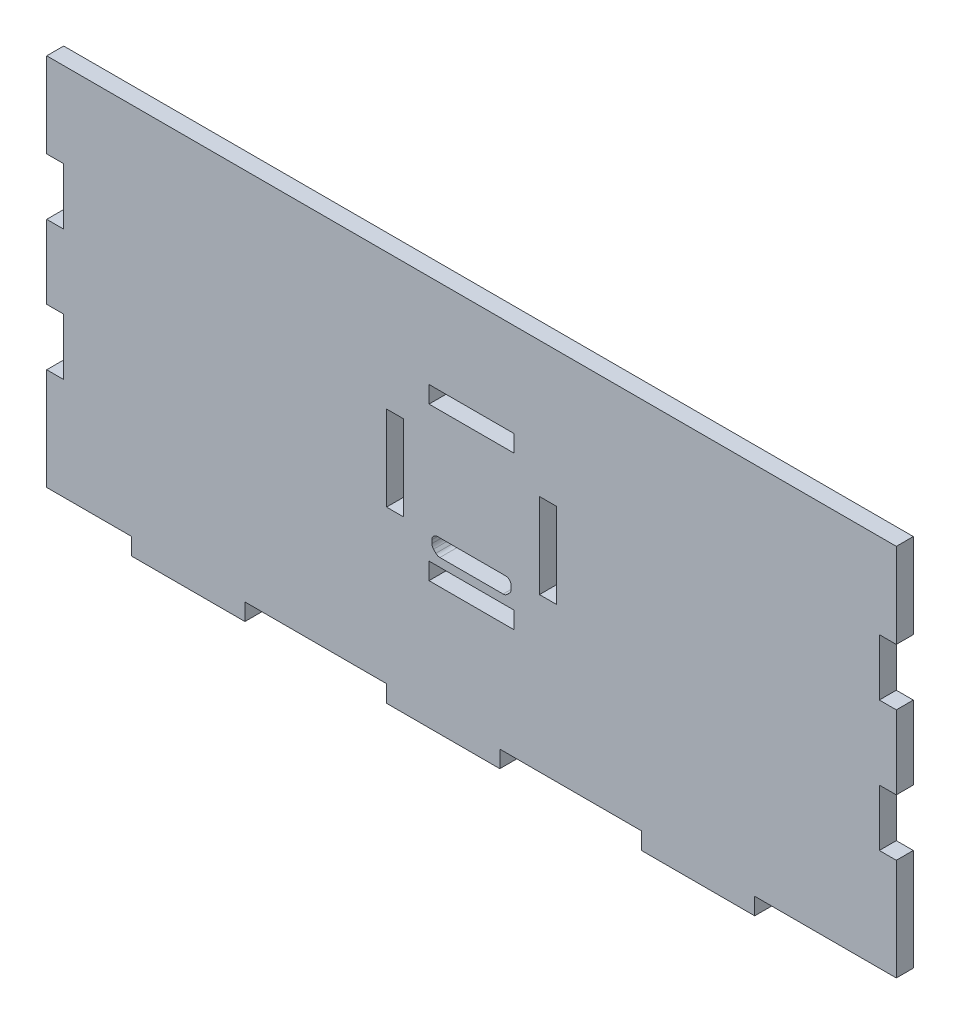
ISO-10303-21;
HEADER;
FILE_DESCRIPTION(('STEP AP214'),'2;1');
FILE_NAME('part.step','',(''),(''),'','','');
FILE_SCHEMA(('AUTOMOTIVE_DESIGN { 1 0 10303 214 1 1 1 1 }'));
ENDSEC;
DATA;
#1=APPLICATION_CONTEXT('core data for automotive mechanical design processes');
#2=APPLICATION_PROTOCOL_DEFINITION('international standard','automotive_design',2000,#1);
#3=PRODUCT_CONTEXT('',#1,'mechanical');
#4=PRODUCT('Part','Part','',(#3));
#5=PRODUCT_RELATED_PRODUCT_CATEGORY('part','',(#4));
#6=PRODUCT_DEFINITION_FORMATION('','',#4);
#7=PRODUCT_DEFINITION_CONTEXT('part definition',#1,'design');
#8=PRODUCT_DEFINITION('design','',#6,#7);
#9=PRODUCT_DEFINITION_SHAPE('','',#8);
#10=(LENGTH_UNIT() NAMED_UNIT(*) SI_UNIT(.MILLI.,.METRE.));
#11=(NAMED_UNIT(*) PLANE_ANGLE_UNIT() SI_UNIT($,.RADIAN.));
#12=(NAMED_UNIT(*) SI_UNIT($,.STERADIAN.) SOLID_ANGLE_UNIT());
#13=UNCERTAINTY_MEASURE_WITH_UNIT(LENGTH_MEASURE(1.E-05),#10,'distance_accuracy_value','');
#14=(GEOMETRIC_REPRESENTATION_CONTEXT(3) GLOBAL_UNCERTAINTY_ASSIGNED_CONTEXT((#13)) GLOBAL_UNIT_ASSIGNED_CONTEXT((#10,
#11,#12)) REPRESENTATION_CONTEXT('',''));
#15=CARTESIAN_POINT('',(0.,0.,0.));
#16=DIRECTION('',(0.,0.,1.));
#17=DIRECTION('',(1.,0.,0.));
#18=AXIS2_PLACEMENT_3D('',#15,#16,#17);
#19=CARTESIAN_POINT('',(0.,0.,3.));
#20=DIRECTION('',(1.,0.,0.));
#21=DIRECTION('',(0.,0.,-1.));
#22=AXIS2_PLACEMENT_3D('',#19,#20,#21);
#23=PLANE('',#22);
#24=DIRECTION('',(0.,-1.,0.));
#25=VECTOR('',#24,1.);
#26=CARTESIAN_POINT('',(0.,0.,3.));
#27=LINE('',#26,#25);
#28=CARTESIAN_POINT('',(0.,44.,3.));
#29=VERTEX_POINT('',#28);
#30=CARTESIAN_POINT('',(0.,31.,3.));
#31=VERTEX_POINT('',#30);
#32=EDGE_CURVE('E447',#29,#31,#27,.T.);
#33=ORIENTED_EDGE('',*,*,#32,.F.);
#34=DIRECTION('',(0.,0.,1.));
#35=VECTOR('',#34,1.);
#36=CARTESIAN_POINT('',(0.,44.,-3.));
#37=LINE('',#36,#35);
#38=CARTESIAN_POINT('',(0.,44.,0.));
#39=VERTEX_POINT('',#38);
#40=EDGE_CURVE('E840',#39,#29,#37,.T.);
#41=ORIENTED_EDGE('',*,*,#40,.F.);
#42=DIRECTION('',(0.,-1.,0.));
#43=VECTOR('',#42,1.);
#44=CARTESIAN_POINT('',(0.,0.,0.));
#45=LINE('',#44,#43);
#46=CARTESIAN_POINT('',(0.,31.,0.));
#47=VERTEX_POINT('',#46);
#48=EDGE_CURVE('E502',#39,#47,#45,.T.);
#49=ORIENTED_EDGE('',*,*,#48,.T.);
#50=DIRECTION('',(0.,0.,1.));
#51=VECTOR('',#50,1.);
#52=CARTESIAN_POINT('',(0.,31.,-3.));
#53=LINE('',#52,#51);
#54=EDGE_CURVE('E824',#47,#31,#53,.T.);
#55=ORIENTED_EDGE('',*,*,#54,.T.);
#56=EDGE_LOOP('',(#33,#41,#49,#55));
#57=FACE_BOUND('',#56,.T.);
#58=ADVANCED_FACE('F39',(#57),#23,.F.);
#59=CARTESIAN_POINT('',(0.,69.,3.));
#60=VERTEX_POINT('',#59);
#61=CARTESIAN_POINT('',(0.,54.,3.));
#62=VERTEX_POINT('',#61);
#63=EDGE_CURVE('E435',#60,#62,#27,.T.);
#64=ORIENTED_EDGE('',*,*,#63,.F.);
#65=DIRECTION('',(0.,0.,1.));
#66=VECTOR('',#65,1.);
#67=CARTESIAN_POINT('',(0.,69.,-3.));
#68=LINE('',#67,#66);
#69=CARTESIAN_POINT('',(0.,69.,0.));
#70=VERTEX_POINT('',#69);
#71=EDGE_CURVE('E417',#70,#60,#68,.T.);
#72=ORIENTED_EDGE('',*,*,#71,.F.);
#73=CARTESIAN_POINT('',(0.,54.,0.));
#74=VERTEX_POINT('',#73);
#75=EDGE_CURVE('E496',#70,#74,#45,.T.);
#76=ORIENTED_EDGE('',*,*,#75,.T.);
#77=DIRECTION('',(0.,0.,1.));
#78=VECTOR('',#77,1.);
#79=CARTESIAN_POINT('',(0.,54.,-3.));
#80=LINE('',#79,#78);
#81=EDGE_CURVE('E444',#74,#62,#80,.T.);
#82=ORIENTED_EDGE('',*,*,#81,.T.);
#83=EDGE_LOOP('',(#64,#72,#76,#82));
#84=FACE_BOUND('',#83,.T.);
#85=ADVANCED_FACE('F443',(#84),#23,.F.);
#86=CARTESIAN_POINT('',(0.,0.,3.));
#87=DIRECTION('',(0.,1.,0.));
#88=DIRECTION('',(0.,0.,1.));
#89=AXIS2_PLACEMENT_3D('',#86,#87,#88);
#90=PLANE('',#89);
#91=DIRECTION('',(1.,0.,0.));
#92=VECTOR('',#91,1.);
#93=CARTESIAN_POINT('',(0.,0.,3.));
#94=LINE('',#93,#92);
#95=CARTESIAN_POINT('',(15.,0.,3.));
#96=VERTEX_POINT('',#95);
#97=CARTESIAN_POINT('',(35.,0.,3.));
#98=VERTEX_POINT('',#97);
#99=EDGE_CURVE('E455',#96,#98,#94,.T.);
#100=ORIENTED_EDGE('',*,*,#99,.F.);
#101=DIRECTION('',(0.,0.,1.));
#102=VECTOR('',#101,1.);
#103=CARTESIAN_POINT('',(15.,0.,-3.));
#104=LINE('',#103,#102);
#105=CARTESIAN_POINT('',(15.,0.,0.));
#106=VERTEX_POINT('',#105);
#107=EDGE_CURVE('E827',#106,#96,#104,.T.);
#108=ORIENTED_EDGE('',*,*,#107,.F.);
#109=DIRECTION('',(1.,0.,0.));
#110=VECTOR('',#109,1.);
#111=CARTESIAN_POINT('',(0.,0.,0.));
#112=LINE('',#111,#110);
#113=CARTESIAN_POINT('',(35.,0.,0.));
#114=VERTEX_POINT('',#113);
#115=EDGE_CURVE('E479',#106,#114,#112,.T.);
#116=ORIENTED_EDGE('',*,*,#115,.T.);
#117=DIRECTION('',(0.,0.,1.));
#118=VECTOR('',#117,1.);
#119=CARTESIAN_POINT('',(35.,0.,-3.));
#120=LINE('',#119,#118);
#121=EDGE_CURVE('E808',#114,#98,#120,.T.);
#122=ORIENTED_EDGE('',*,*,#121,.T.);
#123=EDGE_LOOP('',(#100,#108,#116,#122));
#124=FACE_BOUND('',#123,.T.);
#125=ADVANCED_FACE('F1003',(#124),#90,.F.);
#126=CARTESIAN_POINT('',(60.,0.,3.));
#127=VERTEX_POINT('',#126);
#128=CARTESIAN_POINT('',(80.,0.,3.));
#129=VERTEX_POINT('',#128);
#130=EDGE_CURVE('E453',#127,#129,#94,.T.);
#131=ORIENTED_EDGE('',*,*,#130,.F.);
#132=DIRECTION('',(0.,0.,1.));
#133=VECTOR('',#132,1.);
#134=CARTESIAN_POINT('',(60.,0.,-3.));
#135=LINE('',#134,#133);
#136=CARTESIAN_POINT('',(60.,0.,0.));
#137=VERTEX_POINT('',#136);
#138=EDGE_CURVE('E814',#137,#127,#135,.T.);
#139=ORIENTED_EDGE('',*,*,#138,.F.);
#140=CARTESIAN_POINT('',(80.,0.,0.));
#141=VERTEX_POINT('',#140);
#142=EDGE_CURVE('E485',#137,#141,#112,.T.);
#143=ORIENTED_EDGE('',*,*,#142,.T.);
#144=DIRECTION('',(0.,0.,1.));
#145=VECTOR('',#144,1.);
#146=CARTESIAN_POINT('',(80.,0.,-3.));
#147=LINE('',#146,#145);
#148=EDGE_CURVE('E784',#141,#129,#147,.T.);
#149=ORIENTED_EDGE('',*,*,#148,.T.);
#150=EDGE_LOOP('',(#131,#139,#143,#149));
#151=FACE_BOUND('',#150,.T.);
#152=ADVANCED_FACE('F1012',(#151),#90,.F.);
#153=CARTESIAN_POINT('',(150.,0.,3.));
#154=DIRECTION('',(-1.,0.,0.));
#155=DIRECTION('',(0.,0.,1.));
#156=AXIS2_PLACEMENT_3D('',#153,#154,#155);
#157=PLANE('',#156);
#158=DIRECTION('',(0.,1.,0.));
#159=VECTOR('',#158,1.);
#160=CARTESIAN_POINT('',(150.,0.,3.));
#161=LINE('',#160,#159);
#162=CARTESIAN_POINT('',(150.,31.,3.));
#163=VERTEX_POINT('',#162);
#164=CARTESIAN_POINT('',(150.,44.,3.));
#165=VERTEX_POINT('',#164);
#166=EDGE_CURVE('E1082',#163,#165,#161,.T.);
#167=ORIENTED_EDGE('',*,*,#166,.F.);
#168=DIRECTION('',(0.,0.,1.));
#169=VECTOR('',#168,1.);
#170=CARTESIAN_POINT('',(150.,31.,-3.));
#171=LINE('',#170,#169);
#172=CARTESIAN_POINT('',(150.,31.,0.));
#173=VERTEX_POINT('',#172);
#174=EDGE_CURVE('E610',#173,#163,#171,.T.);
#175=ORIENTED_EDGE('',*,*,#174,.F.);
#176=DIRECTION('',(0.,1.,0.));
#177=VECTOR('',#176,1.);
#178=CARTESIAN_POINT('',(150.,0.,0.));
#179=LINE('',#178,#177);
#180=CARTESIAN_POINT('',(150.,44.,0.));
#181=VERTEX_POINT('',#180);
#182=EDGE_CURVE('E466',#173,#181,#179,.T.);
#183=ORIENTED_EDGE('',*,*,#182,.T.);
#184=DIRECTION('',(0.,0.,1.));
#185=VECTOR('',#184,1.);
#186=CARTESIAN_POINT('',(150.,44.,-3.));
#187=LINE('',#186,#185);
#188=EDGE_CURVE('E653',#181,#165,#187,.T.);
#189=ORIENTED_EDGE('',*,*,#188,.T.);
#190=EDGE_LOOP('',(#167,#175,#183,#189));
#191=FACE_BOUND('',#190,.T.);
#192=ADVANCED_FACE('F1013',(#191),#157,.F.);
#193=CARTESIAN_POINT('',(150.,3.,0.));
#194=VERTEX_POINT('',#193);
#195=CARTESIAN_POINT('',(150.,21.,0.));
#196=VERTEX_POINT('',#195);
#197=EDGE_CURVE('E460',#194,#196,#179,.T.);
#198=ORIENTED_EDGE('',*,*,#197,.T.);
#199=DIRECTION('',(0.,0.,1.));
#200=VECTOR('',#199,1.);
#201=CARTESIAN_POINT('',(150.,21.,-3.));
#202=LINE('',#201,#200);
#203=CARTESIAN_POINT('',(150.,21.,3.));
#204=VERTEX_POINT('',#203);
#205=EDGE_CURVE('E614',#196,#204,#202,.T.);
#206=ORIENTED_EDGE('',*,*,#205,.T.);
#207=CARTESIAN_POINT('',(150.,3.,3.));
#208=VERTEX_POINT('',#207);
#209=EDGE_CURVE('E1087',#208,#204,#161,.T.);
#210=ORIENTED_EDGE('',*,*,#209,.F.);
#211=DIRECTION('',(0.,0.,1.));
#212=VECTOR('',#211,1.);
#213=CARTESIAN_POINT('',(150.,3.,-3.));
#214=LINE('',#213,#212);
#215=EDGE_CURVE('E767',#194,#208,#214,.T.);
#216=ORIENTED_EDGE('',*,*,#215,.F.);
#217=EDGE_LOOP('',(#198,#206,#210,#216));
#218=FACE_BOUND('',#217,.T.);
#219=ADVANCED_FACE('F1006',(#218),#157,.F.);
#220=CARTESIAN_POINT('',(0.,21.,3.));
#221=VERTEX_POINT('',#220);
#222=CARTESIAN_POINT('',(0.,3.,3.));
#223=VERTEX_POINT('',#222);
#224=EDGE_CURVE('E449',#221,#223,#27,.T.);
#225=ORIENTED_EDGE('',*,*,#224,.F.);
#226=DIRECTION('',(0.,0.,1.));
#227=VECTOR('',#226,1.);
#228=CARTESIAN_POINT('',(0.,21.,-3.));
#229=LINE('',#228,#227);
#230=CARTESIAN_POINT('',(0.,21.,0.));
#231=VERTEX_POINT('',#230);
#232=EDGE_CURVE('E847',#231,#221,#229,.T.);
#233=ORIENTED_EDGE('',*,*,#232,.F.);
#234=CARTESIAN_POINT('',(0.,3.,0.));
#235=VERTEX_POINT('',#234);
#236=EDGE_CURVE('E503',#231,#235,#45,.T.);
#237=ORIENTED_EDGE('',*,*,#236,.T.);
#238=DIRECTION('',(0.,0.,1.));
#239=VECTOR('',#238,1.);
#240=CARTESIAN_POINT('',(0.,3.,-3.));
#241=LINE('',#240,#239);
#242=EDGE_CURVE('E800',#235,#223,#241,.T.);
#243=ORIENTED_EDGE('',*,*,#242,.T.);
#244=EDGE_LOOP('',(#225,#233,#237,#243));
#245=FACE_BOUND('',#244,.T.);
#246=ADVANCED_FACE('F41',(#245),#23,.F.);
#247=CARTESIAN_POINT('',(105.,0.,3.));
#248=VERTEX_POINT('',#247);
#249=CARTESIAN_POINT('',(125.,0.,3.));
#250=VERTEX_POINT('',#249);
#251=EDGE_CURVE('E446',#248,#250,#94,.T.);
#252=ORIENTED_EDGE('',*,*,#251,.F.);
#253=DIRECTION('',(0.,0.,1.));
#254=VECTOR('',#253,1.);
#255=CARTESIAN_POINT('',(105.,0.,-3.));
#256=LINE('',#255,#254);
#257=CARTESIAN_POINT('',(105.,0.,0.));
#258=VERTEX_POINT('',#257);
#259=EDGE_CURVE('E790',#258,#248,#256,.T.);
#260=ORIENTED_EDGE('',*,*,#259,.F.);
#261=CARTESIAN_POINT('',(125.,0.,0.));
#262=VERTEX_POINT('',#261);
#263=EDGE_CURVE('E486',#258,#262,#112,.T.);
#264=ORIENTED_EDGE('',*,*,#263,.T.);
#265=DIRECTION('',(0.,0.,1.));
#266=VECTOR('',#265,1.);
#267=CARTESIAN_POINT('',(125.,0.,-3.));
#268=LINE('',#267,#266);
#269=EDGE_CURVE('E764',#262,#250,#268,.T.);
#270=ORIENTED_EDGE('',*,*,#269,.T.);
#271=EDGE_LOOP('',(#252,#260,#264,#270));
#272=FACE_BOUND('',#271,.T.);
#273=ADVANCED_FACE('F1005',(#272),#90,.F.);
#274=CARTESIAN_POINT('',(150.,54.,0.));
#275=VERTEX_POINT('',#274);
#276=CARTESIAN_POINT('',(150.,69.,0.));
#277=VERTEX_POINT('',#276);
#278=EDGE_CURVE('E468',#275,#277,#179,.T.);
#279=ORIENTED_EDGE('',*,*,#278,.T.);
#280=DIRECTION('',(0.,0.,1.));
#281=VECTOR('',#280,1.);
#282=CARTESIAN_POINT('',(150.,69.,-3.));
#283=LINE('',#282,#281);
#284=CARTESIAN_POINT('',(150.,69.,3.));
#285=VERTEX_POINT('',#284);
#286=EDGE_CURVE('E428',#277,#285,#283,.T.);
#287=ORIENTED_EDGE('',*,*,#286,.T.);
#288=CARTESIAN_POINT('',(150.,54.,3.));
#289=VERTEX_POINT('',#288);
#290=EDGE_CURVE('E438',#289,#285,#161,.T.);
#291=ORIENTED_EDGE('',*,*,#290,.F.);
#292=DIRECTION('',(0.,0.,1.));
#293=VECTOR('',#292,1.);
#294=CARTESIAN_POINT('',(150.,54.,-3.));
#295=LINE('',#294,#293);
#296=EDGE_CURVE('E744',#275,#289,#295,.T.);
#297=ORIENTED_EDGE('',*,*,#296,.F.);
#298=EDGE_LOOP('',(#279,#287,#291,#297));
#299=FACE_BOUND('',#298,.T.);
#300=ADVANCED_FACE('F1011',(#299),#157,.F.);
#301=CARTESIAN_POINT('',(0.,0.,3.));
#302=DIRECTION('',(0.,0.,-1.));
#303=DIRECTION('',(-1.,0.,0.));
#304=AXIS2_PLACEMENT_3D('',#301,#302,#303);
#305=PLANE('',#304);
#306=DIRECTION('',(1.,0.,0.));
#307=VECTOR('',#306,1.);
#308=CARTESIAN_POINT('',(67.5,22.5,3.));
#309=LINE('',#308,#307);
#310=CARTESIAN_POINT('',(67.5,22.5,3.));
#311=VERTEX_POINT('',#310);
#312=CARTESIAN_POINT('',(82.5,22.5,3.));
#313=VERTEX_POINT('',#312);
#314=EDGE_CURVE('E574',#311,#313,#309,.T.);
#315=ORIENTED_EDGE('',*,*,#314,.F.);
#316=DIRECTION('',(0.,-1.,0.));
#317=VECTOR('',#316,1.);
#318=CARTESIAN_POINT('',(67.5,25.5,3.));
#319=LINE('',#318,#317);
#320=CARTESIAN_POINT('',(67.5,25.5,3.));
#321=VERTEX_POINT('',#320);
#322=EDGE_CURVE('E55',#321,#311,#319,.T.);
#323=ORIENTED_EDGE('',*,*,#322,.F.);
#324=DIRECTION('',(-1.,0.,0.));
#325=VECTOR('',#324,1.);
#326=CARTESIAN_POINT('',(67.5,25.5,3.));
#327=LINE('',#326,#325);
#328=CARTESIAN_POINT('',(82.5,25.5,3.));
#329=VERTEX_POINT('',#328);
#330=EDGE_CURVE('E582',#329,#321,#327,.T.);
#331=ORIENTED_EDGE('',*,*,#330,.F.);
#332=DIRECTION('',(0.,1.,0.));
#333=VECTOR('',#332,1.);
#334=CARTESIAN_POINT('',(82.5,25.5,3.));
#335=LINE('',#334,#333);
#336=EDGE_CURVE('E578',#313,#329,#335,.T.);
#337=ORIENTED_EDGE('',*,*,#336,.F.);
#338=EDGE_LOOP('',(#315,#323,#331,#337));
#339=FACE_BOUND('',#338,.T.);
#340=DIRECTION('',(1.,0.,0.));
#341=VECTOR('',#340,1.);
#342=CARTESIAN_POINT('',(82.5,49.5,3.));
#343=LINE('',#342,#341);
#344=CARTESIAN_POINT('',(67.5,49.5,3.));
#345=VERTEX_POINT('',#344);
#346=CARTESIAN_POINT('',(82.5,49.5,3.));
#347=VERTEX_POINT('',#346);
#348=EDGE_CURVE('E546',#345,#347,#343,.T.);
#349=ORIENTED_EDGE('',*,*,#348,.F.);
#350=DIRECTION('',(0.,-1.,0.));
#351=VECTOR('',#350,1.);
#352=CARTESIAN_POINT('',(67.5,49.5,3.));
#353=LINE('',#352,#351);
#354=CARTESIAN_POINT('',(67.5,52.5,3.));
#355=VERTEX_POINT('',#354);
#356=EDGE_CURVE('E63',#355,#345,#353,.T.);
#357=ORIENTED_EDGE('',*,*,#356,.F.);
#358=DIRECTION('',(-1.,0.,0.));
#359=VECTOR('',#358,1.);
#360=CARTESIAN_POINT('',(82.5,52.5,3.));
#361=LINE('',#360,#359);
#362=CARTESIAN_POINT('',(82.5,52.5,3.));
#363=VERTEX_POINT('',#362);
#364=EDGE_CURVE('E555',#363,#355,#361,.T.);
#365=ORIENTED_EDGE('',*,*,#364,.F.);
#366=DIRECTION('',(0.,1.,0.));
#367=VECTOR('',#366,1.);
#368=CARTESIAN_POINT('',(82.5,52.5,3.));
#369=LINE('',#368,#367);
#370=EDGE_CURVE('E551',#347,#363,#369,.T.);
#371=ORIENTED_EDGE('',*,*,#370,.F.);
#372=EDGE_LOOP('',(#349,#357,#365,#371));
#373=FACE_BOUND('',#372,.T.);
#374=DIRECTION('',(-1.,0.,0.));
#375=VECTOR('',#374,1.);
#376=CARTESIAN_POINT('',(63.,45.,3.));
#377=LINE('',#376,#375);
#378=CARTESIAN_POINT('',(63.,45.,3.));
#379=VERTEX_POINT('',#378);
#380=CARTESIAN_POINT('',(60.,45.,3.));
#381=VERTEX_POINT('',#380);
#382=EDGE_CURVE('E624',#379,#381,#377,.T.);
#383=ORIENTED_EDGE('',*,*,#382,.F.);
#384=DIRECTION('',(0.,1.,0.));
#385=VECTOR('',#384,1.);
#386=CARTESIAN_POINT('',(63.,45.,3.));
#387=LINE('',#386,#385);
#388=CARTESIAN_POINT('',(62.9999999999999,30.,3.));
#389=VERTEX_POINT('',#388);
#390=EDGE_CURVE('E563',#389,#379,#387,.T.);
#391=ORIENTED_EDGE('',*,*,#390,.F.);
#392=DIRECTION('',(1.,0.,0.));
#393=VECTOR('',#392,1.);
#394=CARTESIAN_POINT('',(62.9999999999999,30.,3.));
#395=LINE('',#394,#393);
#396=CARTESIAN_POINT('',(60.,30.,3.));
#397=VERTEX_POINT('',#396);
#398=EDGE_CURVE('E632',#397,#389,#395,.T.);
#399=ORIENTED_EDGE('',*,*,#398,.F.);
#400=DIRECTION('',(0.,-1.,0.));
#401=VECTOR('',#400,1.);
#402=CARTESIAN_POINT('',(60.,45.,3.));
#403=LINE('',#402,#401);
#404=EDGE_CURVE('E628',#381,#397,#403,.T.);
#405=ORIENTED_EDGE('',*,*,#404,.F.);
#406=EDGE_LOOP('',(#383,#391,#399,#405));
#407=FACE_BOUND('',#406,.T.);
#408=DIRECTION('',(0.,1.,0.));
#409=VECTOR('',#408,1.);
#410=CARTESIAN_POINT('',(90.,37.6219109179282,3.));
#411=LINE('',#410,#409);
#412=CARTESIAN_POINT('',(90.,30.1219109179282,3.));
#413=VERTEX_POINT('',#412);
#414=CARTESIAN_POINT('',(90.,45.1219109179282,3.));
#415=VERTEX_POINT('',#414);
#416=EDGE_CURVE('E519',#413,#415,#411,.T.);
#417=ORIENTED_EDGE('',*,*,#416,.F.);
#418=DIRECTION('',(1.,0.,0.));
#419=VECTOR('',#418,1.);
#420=CARTESIAN_POINT('',(87.,30.1219109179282,3.));
#421=LINE('',#420,#419);
#422=CARTESIAN_POINT('',(87.,30.1219109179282,3.));
#423=VERTEX_POINT('',#422);
#424=EDGE_CURVE('E516',#423,#413,#421,.T.);
#425=ORIENTED_EDGE('',*,*,#424,.F.);
#426=DIRECTION('',(0.,-1.,0.));
#427=VECTOR('',#426,1.);
#428=CARTESIAN_POINT('',(87.,45.1219109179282,3.));
#429=LINE('',#428,#427);
#430=CARTESIAN_POINT('',(87.,45.1219109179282,3.));
#431=VERTEX_POINT('',#430);
#432=EDGE_CURVE('E527',#431,#423,#429,.T.);
#433=ORIENTED_EDGE('',*,*,#432,.F.);
#434=DIRECTION('',(-1.,0.,0.));
#435=VECTOR('',#434,1.);
#436=CARTESIAN_POINT('',(90.,45.1219109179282,3.));
#437=LINE('',#436,#435);
#438=EDGE_CURVE('E523',#415,#431,#437,.T.);
#439=ORIENTED_EDGE('',*,*,#438,.F.);
#440=EDGE_LOOP('',(#417,#425,#433,#439));
#441=FACE_BOUND('',#440,.T.);
#442=DIRECTION('',(1.,0.,0.));
#443=VECTOR('',#442,1.);
#444=CARTESIAN_POINT('',(75.,27.,3.));
#445=LINE('',#444,#443);
#446=CARTESIAN_POINT('',(69.4142135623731,27.,3.));
#447=VERTEX_POINT('',#446);
#448=CARTESIAN_POINT('',(80.5857864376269,27.,3.));
#449=VERTEX_POINT('',#448);
#450=EDGE_CURVE('E648',#447,#449,#445,.T.);
#451=ORIENTED_EDGE('',*,*,#450,.F.);
#452=CARTESIAN_POINT('',(69.4142135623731,28.,3.));
#453=DIRECTION('',(0.,0.,1.));
#454=DIRECTION('',(-1.,0.,0.));
#455=AXIS2_PLACEMENT_3D('',#452,#453,#454);
#456=CIRCLE('',#455,0.999999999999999);
#457=CARTESIAN_POINT('',(68.7071067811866,27.2928932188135,3.));
#458=VERTEX_POINT('',#457);
#459=EDGE_CURVE('E693',#458,#447,#456,.T.);
#460=ORIENTED_EDGE('',*,*,#459,.F.);
#461=DIRECTION('',(0.707106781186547,-0.707106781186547,0.));
#462=VECTOR('',#461,1.);
#463=CARTESIAN_POINT('',(68.2928932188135,27.7071067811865,3.));
#464=LINE('',#463,#462);
#465=CARTESIAN_POINT('',(68.2928932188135,27.7071067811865,3.));
#466=VERTEX_POINT('',#465);
#467=EDGE_CURVE('E689',#466,#458,#464,.T.);
#468=ORIENTED_EDGE('',*,*,#467,.F.);
#469=CARTESIAN_POINT('',(69.,28.4142135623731,3.));
#470=DIRECTION('',(0.,0.,1.));
#471=DIRECTION('',(-1.,0.,0.));
#472=AXIS2_PLACEMENT_3D('',#469,#470,#471);
#473=CIRCLE('',#472,1.);
#474=CARTESIAN_POINT('',(68.,28.4142135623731,3.));
#475=VERTEX_POINT('',#474);
#476=EDGE_CURVE('E685',#475,#466,#473,.T.);
#477=ORIENTED_EDGE('',*,*,#476,.F.);
#478=DIRECTION('',(0.,-1.,0.));
#479=VECTOR('',#478,1.);
#480=CARTESIAN_POINT('',(68.,29.,3.));
#481=LINE('',#480,#479);
#482=CARTESIAN_POINT('',(68.,29.,3.));
#483=VERTEX_POINT('',#482);
#484=EDGE_CURVE('E681',#483,#475,#481,.T.);
#485=ORIENTED_EDGE('',*,*,#484,.F.);
#486=CARTESIAN_POINT('',(69.,29.,3.));
#487=DIRECTION('',(0.,0.,1.));
#488=DIRECTION('',(1.,0.,0.));
#489=AXIS2_PLACEMENT_3D('',#486,#487,#488);
#490=CIRCLE('',#489,1.);
#491=CARTESIAN_POINT('',(69.,30.,3.));
#492=VERTEX_POINT('',#491);
#493=EDGE_CURVE('E677',#492,#483,#490,.T.);
#494=ORIENTED_EDGE('',*,*,#493,.F.);
#495=DIRECTION('',(-1.,0.,0.));
#496=VECTOR('',#495,1.);
#497=CARTESIAN_POINT('',(81.,30.,3.));
#498=LINE('',#497,#496);
#499=CARTESIAN_POINT('',(81.,30.,3.));
#500=VERTEX_POINT('',#499);
#501=EDGE_CURVE('E673',#500,#492,#498,.T.);
#502=ORIENTED_EDGE('',*,*,#501,.F.);
#503=CARTESIAN_POINT('',(81.,29.,3.));
#504=DIRECTION('',(0.,0.,1.));
#505=DIRECTION('',(1.,0.,0.));
#506=AXIS2_PLACEMENT_3D('',#503,#504,#505);
#507=CIRCLE('',#506,1.);
#508=CARTESIAN_POINT('',(82.,29.,3.));
#509=VERTEX_POINT('',#508);
#510=EDGE_CURVE('E669',#509,#500,#507,.T.);
#511=ORIENTED_EDGE('',*,*,#510,.F.);
#512=DIRECTION('',(0.,1.,0.));
#513=VECTOR('',#512,1.);
#514=CARTESIAN_POINT('',(82.,28.4142135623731,3.));
#515=LINE('',#514,#513);
#516=CARTESIAN_POINT('',(82.,28.4142135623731,3.));
#517=VERTEX_POINT('',#516);
#518=EDGE_CURVE('E665',#517,#509,#515,.T.);
#519=ORIENTED_EDGE('',*,*,#518,.F.);
#520=CARTESIAN_POINT('',(81.,28.4142135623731,3.));
#521=DIRECTION('',(0.,0.,1.));
#522=DIRECTION('',(-1.,0.,0.));
#523=AXIS2_PLACEMENT_3D('',#520,#521,#522);
#524=CIRCLE('',#523,1.);
#525=CARTESIAN_POINT('',(81.7071067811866,27.7071067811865,3.));
#526=VERTEX_POINT('',#525);
#527=EDGE_CURVE('E661',#526,#517,#524,.T.);
#528=ORIENTED_EDGE('',*,*,#527,.F.);
#529=DIRECTION('',(0.707106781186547,0.707106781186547,0.));
#530=VECTOR('',#529,1.);
#531=CARTESIAN_POINT('',(81.2928932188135,27.2928932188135,3.));
#532=LINE('',#531,#530);
#533=CARTESIAN_POINT('',(81.2928932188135,27.2928932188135,3.));
#534=VERTEX_POINT('',#533);
#535=EDGE_CURVE('E657',#534,#526,#532,.T.);
#536=ORIENTED_EDGE('',*,*,#535,.F.);
#537=CARTESIAN_POINT('',(80.5857864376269,28.,3.));
#538=DIRECTION('',(0.,0.,1.));
#539=DIRECTION('',(1.,0.,0.));
#540=AXIS2_PLACEMENT_3D('',#537,#538,#539);
#541=CIRCLE('',#540,0.999999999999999);
#542=EDGE_CURVE('E652',#449,#534,#541,.T.);
#543=ORIENTED_EDGE('',*,*,#542,.F.);
#544=EDGE_LOOP('',(#451,#460,#468,#477,#485,#494,#502,#511,#519,#528,#536,#543));
#545=FACE_BOUND('',#544,.T.);
#546=ORIENTED_EDGE('',*,*,#290,.T.);
#547=DIRECTION('',(1.,0.,0.));
#548=VECTOR('',#547,1.);
#549=CARTESIAN_POINT('',(0.,69.,3.));
#550=LINE('',#549,#548);
#551=EDGE_CURVE('E420',#60,#285,#550,.T.);
#552=ORIENTED_EDGE('',*,*,#551,.F.);
#553=ORIENTED_EDGE('',*,*,#63,.T.);
#554=DIRECTION('',(-1.,0.,0.));
#555=VECTOR('',#554,1.);
#556=CARTESIAN_POINT('',(0.,54.,3.));
#557=LINE('',#556,#555);
#558=CARTESIAN_POINT('',(3.,54.,3.));
#559=VERTEX_POINT('',#558);
#560=EDGE_CURVE('E866',#559,#62,#557,.T.);
#561=ORIENTED_EDGE('',*,*,#560,.F.);
#562=DIRECTION('',(0.,1.,0.));
#563=VECTOR('',#562,1.);
#564=CARTESIAN_POINT('',(3.,54.,3.));
#565=LINE('',#564,#563);
#566=CARTESIAN_POINT('',(3.,44.,3.));
#567=VERTEX_POINT('',#566);
#568=EDGE_CURVE('E862',#567,#559,#565,.T.);
#569=ORIENTED_EDGE('',*,*,#568,.F.);
#570=DIRECTION('',(1.,0.,0.));
#571=VECTOR('',#570,1.);
#572=CARTESIAN_POINT('',(3.,44.,3.));
#573=LINE('',#572,#571);
#574=EDGE_CURVE('E613',#29,#567,#573,.T.);
#575=ORIENTED_EDGE('',*,*,#574,.F.);
#576=ORIENTED_EDGE('',*,*,#32,.T.);
#577=DIRECTION('',(-1.,0.,0.));
#578=VECTOR('',#577,1.);
#579=CARTESIAN_POINT('',(3.,31.,3.));
#580=LINE('',#579,#578);
#581=CARTESIAN_POINT('',(3.,31.,3.));
#582=VERTEX_POINT('',#581);
#583=EDGE_CURVE('E844',#582,#31,#580,.T.);
#584=ORIENTED_EDGE('',*,*,#583,.F.);
#585=DIRECTION('',(0.,1.,0.));
#586=VECTOR('',#585,1.);
#587=CARTESIAN_POINT('',(3.,21.,3.));
#588=LINE('',#587,#586);
#589=CARTESIAN_POINT('',(3.,21.,3.));
#590=VERTEX_POINT('',#589);
#591=EDGE_CURVE('E839',#590,#582,#588,.T.);
#592=ORIENTED_EDGE('',*,*,#591,.F.);
#593=DIRECTION('',(1.,0.,0.));
#594=VECTOR('',#593,1.);
#595=CARTESIAN_POINT('',(0.,21.,3.));
#596=LINE('',#595,#594);
#597=EDGE_CURVE('E835',#221,#590,#596,.T.);
#598=ORIENTED_EDGE('',*,*,#597,.F.);
#599=ORIENTED_EDGE('',*,*,#224,.T.);
#600=DIRECTION('',(-1.,0.,0.));
#601=VECTOR('',#600,1.);
#602=CARTESIAN_POINT('',(0.,3.,3.));
#603=LINE('',#602,#601);
#604=CARTESIAN_POINT('',(15.,3.,3.));
#605=VERTEX_POINT('',#604);
#606=EDGE_CURVE('E823',#605,#223,#603,.T.);
#607=ORIENTED_EDGE('',*,*,#606,.F.);
#608=DIRECTION('',(0.,1.,0.));
#609=VECTOR('',#608,1.);
#610=CARTESIAN_POINT('',(15.,3.,3.));
#611=LINE('',#610,#609);
#612=EDGE_CURVE('E819',#96,#605,#611,.T.);
#613=ORIENTED_EDGE('',*,*,#612,.F.);
#614=ORIENTED_EDGE('',*,*,#99,.T.);
#615=DIRECTION('',(0.,-1.,0.));
#616=VECTOR('',#615,1.);
#617=CARTESIAN_POINT('',(35.,0.,3.));
#618=LINE('',#617,#616);
#619=CARTESIAN_POINT('',(35.,3.,3.));
#620=VERTEX_POINT('',#619);
#621=EDGE_CURVE('E796',#620,#98,#618,.T.);
#622=ORIENTED_EDGE('',*,*,#621,.F.);
#623=DIRECTION('',(-1.,0.,0.));
#624=VECTOR('',#623,1.);
#625=CARTESIAN_POINT('',(35.,3.,3.));
#626=LINE('',#625,#624);
#627=CARTESIAN_POINT('',(60.,3.,3.));
#628=VERTEX_POINT('',#627);
#629=EDGE_CURVE('E804',#628,#620,#626,.T.);
#630=ORIENTED_EDGE('',*,*,#629,.F.);
#631=DIRECTION('',(0.,1.,0.));
#632=VECTOR('',#631,1.);
#633=CARTESIAN_POINT('',(60.,3.,3.));
#634=LINE('',#633,#632);
#635=EDGE_CURVE('E799',#127,#628,#634,.T.);
#636=ORIENTED_EDGE('',*,*,#635,.F.);
#637=ORIENTED_EDGE('',*,*,#130,.T.);
#638=DIRECTION('',(0.,-1.,0.));
#639=VECTOR('',#638,1.);
#640=CARTESIAN_POINT('',(80.,0.,3.));
#641=LINE('',#640,#639);
#642=CARTESIAN_POINT('',(80.,3.,3.));
#643=VERTEX_POINT('',#642);
#644=EDGE_CURVE('E772',#643,#129,#641,.T.);
#645=ORIENTED_EDGE('',*,*,#644,.F.);
#646=DIRECTION('',(-1.,0.,0.));
#647=VECTOR('',#646,1.);
#648=CARTESIAN_POINT('',(80.,3.,3.));
#649=LINE('',#648,#647);
#650=CARTESIAN_POINT('',(105.,3.,3.));
#651=VERTEX_POINT('',#650);
#652=EDGE_CURVE('E780',#651,#643,#649,.T.);
#653=ORIENTED_EDGE('',*,*,#652,.F.);
#654=DIRECTION('',(0.,1.,0.));
#655=VECTOR('',#654,1.);
#656=CARTESIAN_POINT('',(105.,3.,3.));
#657=LINE('',#656,#655);
#658=EDGE_CURVE('E775',#248,#651,#657,.T.);
#659=ORIENTED_EDGE('',*,*,#658,.F.);
#660=ORIENTED_EDGE('',*,*,#251,.T.);
#661=DIRECTION('',(0.,-1.,0.));
#662=VECTOR('',#661,1.);
#663=CARTESIAN_POINT('',(125.,0.,3.));
#664=LINE('',#663,#662);
#665=CARTESIAN_POINT('',(125.,3.,3.));
#666=VERTEX_POINT('',#665);
#667=EDGE_CURVE('E756',#666,#250,#664,.T.);
#668=ORIENTED_EDGE('',*,*,#667,.F.);
#669=DIRECTION('',(-1.,0.,0.));
#670=VECTOR('',#669,1.);
#671=CARTESIAN_POINT('',(125.,3.,3.));
#672=LINE('',#671,#670);
#673=EDGE_CURVE('E759',#208,#666,#672,.T.);
#674=ORIENTED_EDGE('',*,*,#673,.F.);
#675=ORIENTED_EDGE('',*,*,#209,.T.);
#676=DIRECTION('',(1.,0.,0.));
#677=VECTOR('',#676,1.);
#678=CARTESIAN_POINT('',(150.,21.,3.));
#679=LINE('',#678,#677);
#680=CARTESIAN_POINT('',(147.,21.,3.));
#681=VERTEX_POINT('',#680);
#682=EDGE_CURVE('E606',#681,#204,#679,.T.);
#683=ORIENTED_EDGE('',*,*,#682,.F.);
#684=DIRECTION('',(0.,-1.,0.));
#685=VECTOR('',#684,1.);
#686=CARTESIAN_POINT('',(147.,21.,3.));
#687=LINE('',#686,#685);
#688=CARTESIAN_POINT('',(147.,31.,3.));
#689=VERTEX_POINT('',#688);
#690=EDGE_CURVE('E601',#689,#681,#687,.T.);
#691=ORIENTED_EDGE('',*,*,#690,.F.);
#692=DIRECTION('',(-1.,0.,0.));
#693=VECTOR('',#692,1.);
#694=CARTESIAN_POINT('',(147.,31.,3.));
#695=LINE('',#694,#693);
#696=EDGE_CURVE('E597',#163,#689,#695,.T.);
#697=ORIENTED_EDGE('',*,*,#696,.F.);
#698=ORIENTED_EDGE('',*,*,#166,.T.);
#699=DIRECTION('',(1.,0.,0.));
#700=VECTOR('',#699,1.);
#701=CARTESIAN_POINT('',(147.,44.,3.));
#702=LINE('',#701,#700);
#703=CARTESIAN_POINT('',(147.,44.,3.));
#704=VERTEX_POINT('',#703);
#705=EDGE_CURVE('E741',#704,#165,#702,.T.);
#706=ORIENTED_EDGE('',*,*,#705,.F.);
#707=DIRECTION('',(0.,-1.,0.));
#708=VECTOR('',#707,1.);
#709=CARTESIAN_POINT('',(147.,54.,3.));
#710=LINE('',#709,#708);
#711=CARTESIAN_POINT('',(147.,54.,3.));
#712=VERTEX_POINT('',#711);
#713=EDGE_CURVE('E736',#712,#704,#710,.T.);
#714=ORIENTED_EDGE('',*,*,#713,.F.);
#715=DIRECTION('',(-1.,0.,0.));
#716=VECTOR('',#715,1.);
#717=CARTESIAN_POINT('',(150.,54.,3.));
#718=LINE('',#717,#716);
#719=EDGE_CURVE('E732',#289,#712,#718,.T.);
#720=ORIENTED_EDGE('',*,*,#719,.F.);
#721=EDGE_LOOP('',(#546,#552,#553,#561,#569,#575,#576,#584,#592,#598,#599,#607,#613,#614,#622,
#630,#636,#637,#645,#653,#659,#660,#668,#674,#675,#683,#691,#697,#698,#706,#714,#720));
#722=FACE_BOUND('',#721,.T.);
#723=ADVANCED_FACE('F433',(#339,#373,#407,#441,#545,#722),#305,.F.);
#724=CARTESIAN_POINT('',(0.,0.,0.));
#725=DIRECTION('',(0.,0.,-1.));
#726=DIRECTION('',(-1.,0.,0.));
#727=AXIS2_PLACEMENT_3D('',#724,#725,#726);
#728=PLANE('',#727);
#729=DIRECTION('',(-1.,0.,0.));
#730=VECTOR('',#729,1.);
#731=CARTESIAN_POINT('',(0.,69.,0.));
#732=LINE('',#731,#730);
#733=EDGE_CURVE('E11',#277,#70,#732,.T.);
#734=ORIENTED_EDGE('',*,*,#733,.F.);
#735=ORIENTED_EDGE('',*,*,#278,.F.);
#736=DIRECTION('',(1.,0.,0.));
#737=VECTOR('',#736,1.);
#738=CARTESIAN_POINT('',(0.,54.,0.));
#739=LINE('',#738,#737);
#740=CARTESIAN_POINT('',(147.,54.,0.));
#741=VERTEX_POINT('',#740);
#742=EDGE_CURVE('E1674',#741,#275,#739,.T.);
#743=ORIENTED_EDGE('',*,*,#742,.F.);
#744=DIRECTION('',(0.,1.,0.));
#745=VECTOR('',#744,1.);
#746=CARTESIAN_POINT('',(147.,0.,0.));
#747=LINE('',#746,#745);
#748=CARTESIAN_POINT('',(147.,44.,0.));
#749=VERTEX_POINT('',#748);
#750=EDGE_CURVE('E1678',#749,#741,#747,.T.);
#751=ORIENTED_EDGE('',*,*,#750,.F.);
#752=DIRECTION('',(-1.,0.,0.));
#753=VECTOR('',#752,1.);
#754=CARTESIAN_POINT('',(0.,44.,0.));
#755=LINE('',#754,#753);
#756=EDGE_CURVE('E1687',#181,#749,#755,.T.);
#757=ORIENTED_EDGE('',*,*,#756,.F.);
#758=ORIENTED_EDGE('',*,*,#182,.F.);
#759=DIRECTION('',(1.,0.,0.));
#760=VECTOR('',#759,1.);
#761=CARTESIAN_POINT('',(0.,31.,0.));
#762=LINE('',#761,#760);
#763=CARTESIAN_POINT('',(147.,31.,0.));
#764=VERTEX_POINT('',#763);
#765=EDGE_CURVE('E931',#764,#173,#762,.T.);
#766=ORIENTED_EDGE('',*,*,#765,.F.);
#767=DIRECTION('',(0.,1.,0.));
#768=VECTOR('',#767,1.);
#769=CARTESIAN_POINT('',(147.,0.,0.));
#770=LINE('',#769,#768);
#771=CARTESIAN_POINT('',(147.,21.,0.));
#772=VERTEX_POINT('',#771);
#773=EDGE_CURVE('E924',#772,#764,#770,.T.);
#774=ORIENTED_EDGE('',*,*,#773,.F.);
#775=DIRECTION('',(-1.,0.,0.));
#776=VECTOR('',#775,1.);
#777=CARTESIAN_POINT('',(0.,21.,0.));
#778=LINE('',#777,#776);
#779=EDGE_CURVE('E927',#196,#772,#778,.T.);
#780=ORIENTED_EDGE('',*,*,#779,.F.);
#781=ORIENTED_EDGE('',*,*,#197,.F.);
#782=DIRECTION('',(1.,0.,0.));
#783=VECTOR('',#782,1.);
#784=CARTESIAN_POINT('',(0.,3.,0.));
#785=LINE('',#784,#783);
#786=CARTESIAN_POINT('',(125.,3.,0.));
#787=VERTEX_POINT('',#786);
#788=EDGE_CURVE('E1690',#787,#194,#785,.T.);
#789=ORIENTED_EDGE('',*,*,#788,.F.);
#790=DIRECTION('',(0.,1.,0.));
#791=VECTOR('',#790,1.);
#792=CARTESIAN_POINT('',(125.,0.,0.));
#793=LINE('',#792,#791);
#794=EDGE_CURVE('E1693',#262,#787,#793,.T.);
#795=ORIENTED_EDGE('',*,*,#794,.F.);
#796=ORIENTED_EDGE('',*,*,#263,.F.);
#797=DIRECTION('',(0.,-1.,0.));
#798=VECTOR('',#797,1.);
#799=CARTESIAN_POINT('',(105.,0.,0.));
#800=LINE('',#799,#798);
#801=CARTESIAN_POINT('',(105.,3.,0.));
#802=VERTEX_POINT('',#801);
#803=EDGE_CURVE('E1123',#802,#258,#800,.T.);
#804=ORIENTED_EDGE('',*,*,#803,.F.);
#805=DIRECTION('',(1.,0.,0.));
#806=VECTOR('',#805,1.);
#807=CARTESIAN_POINT('',(0.,3.,0.));
#808=LINE('',#807,#806);
#809=CARTESIAN_POINT('',(80.,3.,0.));
#810=VERTEX_POINT('',#809);
#811=EDGE_CURVE('E1115',#810,#802,#808,.T.);
#812=ORIENTED_EDGE('',*,*,#811,.F.);
#813=DIRECTION('',(0.,1.,0.));
#814=VECTOR('',#813,1.);
#815=CARTESIAN_POINT('',(80.,0.,0.));
#816=LINE('',#815,#814);
#817=EDGE_CURVE('E1109',#141,#810,#816,.T.);
#818=ORIENTED_EDGE('',*,*,#817,.F.);
#819=ORIENTED_EDGE('',*,*,#142,.F.);
#820=DIRECTION('',(0.,-1.,0.));
#821=VECTOR('',#820,1.);
#822=CARTESIAN_POINT('',(60.,0.,0.));
#823=LINE('',#822,#821);
#824=CARTESIAN_POINT('',(60.,3.,0.));
#825=VERTEX_POINT('',#824);
#826=EDGE_CURVE('E1117',#825,#137,#823,.T.);
#827=ORIENTED_EDGE('',*,*,#826,.F.);
#828=DIRECTION('',(1.,0.,0.));
#829=VECTOR('',#828,1.);
#830=CARTESIAN_POINT('',(0.,3.,0.));
#831=LINE('',#830,#829);
#832=CARTESIAN_POINT('',(35.,3.,0.));
#833=VERTEX_POINT('',#832);
#834=EDGE_CURVE('E1121',#833,#825,#831,.T.);
#835=ORIENTED_EDGE('',*,*,#834,.F.);
#836=DIRECTION('',(0.,1.,0.));
#837=VECTOR('',#836,1.);
#838=CARTESIAN_POINT('',(35.,0.,0.));
#839=LINE('',#838,#837);
#840=EDGE_CURVE('E1029',#114,#833,#839,.T.);
#841=ORIENTED_EDGE('',*,*,#840,.F.);
#842=ORIENTED_EDGE('',*,*,#115,.F.);
#843=DIRECTION('',(0.,-1.,0.));
#844=VECTOR('',#843,1.);
#845=CARTESIAN_POINT('',(15.,0.,0.));
#846=LINE('',#845,#844);
#847=CARTESIAN_POINT('',(15.,3.,0.));
#848=VERTEX_POINT('',#847);
#849=EDGE_CURVE('E1022',#848,#106,#846,.T.);
#850=ORIENTED_EDGE('',*,*,#849,.F.);
#851=DIRECTION('',(1.,0.,0.));
#852=VECTOR('',#851,1.);
#853=CARTESIAN_POINT('',(0.,3.,0.));
#854=LINE('',#853,#852);
#855=EDGE_CURVE('E1019',#235,#848,#854,.T.);
#856=ORIENTED_EDGE('',*,*,#855,.F.);
#857=ORIENTED_EDGE('',*,*,#236,.F.);
#858=DIRECTION('',(-1.,0.,0.));
#859=VECTOR('',#858,1.);
#860=CARTESIAN_POINT('',(0.,21.,0.));
#861=LINE('',#860,#859);
#862=CARTESIAN_POINT('',(3.,21.,0.));
#863=VERTEX_POINT('',#862);
#864=EDGE_CURVE('E1024',#863,#231,#861,.T.);
#865=ORIENTED_EDGE('',*,*,#864,.F.);
#866=DIRECTION('',(0.,-1.,0.));
#867=VECTOR('',#866,1.);
#868=CARTESIAN_POINT('',(3.,0.,0.));
#869=LINE('',#868,#867);
#870=CARTESIAN_POINT('',(3.,31.,0.));
#871=VERTEX_POINT('',#870);
#872=EDGE_CURVE('E905',#871,#863,#869,.T.);
#873=ORIENTED_EDGE('',*,*,#872,.F.);
#874=DIRECTION('',(1.,0.,0.));
#875=VECTOR('',#874,1.);
#876=CARTESIAN_POINT('',(0.,31.,0.));
#877=LINE('',#876,#875);
#878=EDGE_CURVE('E902',#47,#871,#877,.T.);
#879=ORIENTED_EDGE('',*,*,#878,.F.);
#880=ORIENTED_EDGE('',*,*,#48,.F.);
#881=DIRECTION('',(-1.,0.,0.));
#882=VECTOR('',#881,1.);
#883=CARTESIAN_POINT('',(0.,44.,0.));
#884=LINE('',#883,#882);
#885=CARTESIAN_POINT('',(3.,44.,0.));
#886=VERTEX_POINT('',#885);
#887=EDGE_CURVE('E896',#886,#39,#884,.T.);
#888=ORIENTED_EDGE('',*,*,#887,.F.);
#889=DIRECTION('',(0.,-1.,0.));
#890=VECTOR('',#889,1.);
#891=CARTESIAN_POINT('',(3.,0.,0.));
#892=LINE('',#891,#890);
#893=CARTESIAN_POINT('',(3.,54.,0.));
#894=VERTEX_POINT('',#893);
#895=EDGE_CURVE('E882',#894,#886,#892,.T.);
#896=ORIENTED_EDGE('',*,*,#895,.F.);
#897=DIRECTION('',(1.,0.,0.));
#898=VECTOR('',#897,1.);
#899=CARTESIAN_POINT('',(0.,54.,0.));
#900=LINE('',#899,#898);
#901=EDGE_CURVE('E893',#74,#894,#900,.T.);
#902=ORIENTED_EDGE('',*,*,#901,.F.);
#903=ORIENTED_EDGE('',*,*,#75,.F.);
#904=EDGE_LOOP('',(#734,#735,#743,#751,#757,#758,#766,#774,#780,#781,#789,#795,#796,#804,#812,
#818,#819,#827,#835,#841,#842,#850,#856,#857,#865,#873,#879,#880,#888,#896,#902,#903));
#905=FACE_BOUND('',#904,.T.);
#906=DIRECTION('',(0.,1.,0.));
#907=VECTOR('',#906,1.);
#908=CARTESIAN_POINT('',(67.5,0.,0.));
#909=LINE('',#908,#907);
#910=CARTESIAN_POINT('',(67.5,22.5,0.));
#911=VERTEX_POINT('',#910);
#912=CARTESIAN_POINT('',(67.5,25.5,0.));
#913=VERTEX_POINT('',#912);
#914=EDGE_CURVE('E48',#911,#913,#909,.T.);
#915=ORIENTED_EDGE('',*,*,#914,.F.);
#916=DIRECTION('',(-1.,0.,0.));
#917=VECTOR('',#916,1.);
#918=CARTESIAN_POINT('',(0.,22.5,0.));
#919=LINE('',#918,#917);
#920=CARTESIAN_POINT('',(82.5,22.5,0.));
#921=VERTEX_POINT('',#920);
#922=EDGE_CURVE('E960',#921,#911,#919,.T.);
#923=ORIENTED_EDGE('',*,*,#922,.F.);
#924=DIRECTION('',(0.,-1.,0.));
#925=VECTOR('',#924,1.);
#926=CARTESIAN_POINT('',(82.5,0.,0.));
#927=LINE('',#926,#925);
#928=CARTESIAN_POINT('',(82.5,25.5,0.));
#929=VERTEX_POINT('',#928);
#930=EDGE_CURVE('E963',#929,#921,#927,.T.);
#931=ORIENTED_EDGE('',*,*,#930,.F.);
#932=DIRECTION('',(1.,0.,0.));
#933=VECTOR('',#932,1.);
#934=CARTESIAN_POINT('',(0.,25.5,0.));
#935=LINE('',#934,#933);
#936=EDGE_CURVE('E967',#913,#929,#935,.T.);
#937=ORIENTED_EDGE('',*,*,#936,.F.);
#938=EDGE_LOOP('',(#915,#923,#931,#937));
#939=FACE_BOUND('',#938,.T.);
#940=DIRECTION('',(0.,1.,0.));
#941=VECTOR('',#940,1.);
#942=CARTESIAN_POINT('',(67.5,0.,0.));
#943=LINE('',#942,#941);
#944=CARTESIAN_POINT('',(67.5,49.5,0.));
#945=VERTEX_POINT('',#944);
#946=CARTESIAN_POINT('',(67.5,52.5,0.));
#947=VERTEX_POINT('',#946);
#948=EDGE_CURVE('E957',#945,#947,#943,.T.);
#949=ORIENTED_EDGE('',*,*,#948,.F.);
#950=DIRECTION('',(-1.,0.,0.));
#951=VECTOR('',#950,1.);
#952=CARTESIAN_POINT('',(0.,49.5,0.));
#953=LINE('',#952,#951);
#954=CARTESIAN_POINT('',(82.5,49.5,0.));
#955=VERTEX_POINT('',#954);
#956=EDGE_CURVE('E947',#955,#945,#953,.T.);
#957=ORIENTED_EDGE('',*,*,#956,.F.);
#958=DIRECTION('',(0.,-1.,0.));
#959=VECTOR('',#958,1.);
#960=CARTESIAN_POINT('',(82.5,0.,0.));
#961=LINE('',#960,#959);
#962=CARTESIAN_POINT('',(82.5,52.5,0.));
#963=VERTEX_POINT('',#962);
#964=EDGE_CURVE('E950',#963,#955,#961,.T.);
#965=ORIENTED_EDGE('',*,*,#964,.F.);
#966=DIRECTION('',(1.,0.,0.));
#967=VECTOR('',#966,1.);
#968=CARTESIAN_POINT('',(0.,52.5,0.));
#969=LINE('',#968,#967);
#970=EDGE_CURVE('E954',#947,#963,#969,.T.);
#971=ORIENTED_EDGE('',*,*,#970,.F.);
#972=EDGE_LOOP('',(#949,#957,#965,#971));
#973=FACE_BOUND('',#972,.T.);
#974=DIRECTION('',(0.,-1.,0.));
#975=VECTOR('',#974,1.);
#976=CARTESIAN_POINT('',(62.9999999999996,-5.24580379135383E-13,0.));
#977=LINE('',#976,#975);
#978=CARTESIAN_POINT('',(63.,45.,0.));
#979=VERTEX_POINT('',#978);
#980=CARTESIAN_POINT('',(62.9999999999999,30.,0.));
#981=VERTEX_POINT('',#980);
#982=EDGE_CURVE('E944',#979,#981,#977,.T.);
#983=ORIENTED_EDGE('',*,*,#982,.F.);
#984=DIRECTION('',(1.,0.,0.));
#985=VECTOR('',#984,1.);
#986=CARTESIAN_POINT('',(-1.04083408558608E-13,44.9999999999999,0.));
#987=LINE('',#986,#985);
#988=CARTESIAN_POINT('',(60.,45.,0.));
#989=VERTEX_POINT('',#988);
#990=EDGE_CURVE('E934',#989,#979,#987,.T.);
#991=ORIENTED_EDGE('',*,*,#990,.F.);
#992=DIRECTION('',(0.,1.,0.));
#993=VECTOR('',#992,1.);
#994=CARTESIAN_POINT('',(60.,0.,0.));
#995=LINE('',#994,#993);
#996=CARTESIAN_POINT('',(60.,30.,0.));
#997=VERTEX_POINT('',#996);
#998=EDGE_CURVE('E937',#997,#989,#995,.T.);
#999=ORIENTED_EDGE('',*,*,#998,.F.);
#1000=DIRECTION('',(-1.,0.,0.));
#1001=VECTOR('',#1000,1.);
#1002=CARTESIAN_POINT('',(0.,30.,0.));
#1003=LINE('',#1002,#1001);
#1004=EDGE_CURVE('E941',#981,#997,#1003,.T.);
#1005=ORIENTED_EDGE('',*,*,#1004,.F.);
#1006=EDGE_LOOP('',(#983,#991,#999,#1005));
#1007=FACE_BOUND('',#1006,.T.);
#1008=DIRECTION('',(-1.,0.,0.));
#1009=VECTOR('',#1008,1.);
#1010=CARTESIAN_POINT('',(0.,30.1219109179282,0.));
#1011=LINE('',#1010,#1009);
#1012=CARTESIAN_POINT('',(90.,30.1219109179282,0.));
#1013=VERTEX_POINT('',#1012);
#1014=CARTESIAN_POINT('',(87.,30.1219109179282,0.));
#1015=VERTEX_POINT('',#1014);
#1016=EDGE_CURVE('E921',#1013,#1015,#1011,.T.);
#1017=ORIENTED_EDGE('',*,*,#1016,.F.);
#1018=DIRECTION('',(0.,-1.,0.));
#1019=VECTOR('',#1018,1.);
#1020=CARTESIAN_POINT('',(90.,0.,0.));
#1021=LINE('',#1020,#1019);
#1022=CARTESIAN_POINT('',(90.,45.1219109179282,0.));
#1023=VERTEX_POINT('',#1022);
#1024=EDGE_CURVE('E911',#1023,#1013,#1021,.T.);
#1025=ORIENTED_EDGE('',*,*,#1024,.F.);
#1026=DIRECTION('',(1.,0.,0.));
#1027=VECTOR('',#1026,1.);
#1028=CARTESIAN_POINT('',(0.,45.1219109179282,0.));
#1029=LINE('',#1028,#1027);
#1030=CARTESIAN_POINT('',(87.,45.1219109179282,0.));
#1031=VERTEX_POINT('',#1030);
#1032=EDGE_CURVE('E914',#1031,#1023,#1029,.T.);
#1033=ORIENTED_EDGE('',*,*,#1032,.F.);
#1034=DIRECTION('',(0.,1.,0.));
#1035=VECTOR('',#1034,1.);
#1036=CARTESIAN_POINT('',(87.,0.,0.));
#1037=LINE('',#1036,#1035);
#1038=EDGE_CURVE('E918',#1015,#1031,#1037,.T.);
#1039=ORIENTED_EDGE('',*,*,#1038,.F.);
#1040=EDGE_LOOP('',(#1017,#1025,#1033,#1039));
#1041=FACE_BOUND('',#1040,.T.);
#1042=CARTESIAN_POINT('',(69.4142135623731,28.,0.));
#1043=DIRECTION('',(0.,0.,-1.));
#1044=DIRECTION('',(-1.,0.,0.));
#1045=AXIS2_PLACEMENT_3D('',#1042,#1043,#1044);
#1046=CIRCLE('',#1045,0.999999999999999);
#1047=CARTESIAN_POINT('',(69.4142135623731,27.,0.));
#1048=VERTEX_POINT('',#1047);
#1049=CARTESIAN_POINT('',(68.7071067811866,27.2928932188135,0.));
#1050=VERTEX_POINT('',#1049);
#1051=EDGE_CURVE('E1666',#1048,#1050,#1046,.T.);
#1052=ORIENTED_EDGE('',*,*,#1051,.F.);
#1053=DIRECTION('',(-1.,0.,0.));
#1054=VECTOR('',#1053,1.);
#1055=CARTESIAN_POINT('',(0.,27.,0.));
#1056=LINE('',#1055,#1054);
#1057=CARTESIAN_POINT('',(80.5857864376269,27.,0.));
#1058=VERTEX_POINT('',#1057);
#1059=EDGE_CURVE('E1091',#1058,#1048,#1056,.T.);
#1060=ORIENTED_EDGE('',*,*,#1059,.F.);
#1061=CARTESIAN_POINT('',(80.5857864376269,28.,0.));
#1062=DIRECTION('',(0.,0.,-1.));
#1063=DIRECTION('',(-1.,0.,0.));
#1064=AXIS2_PLACEMENT_3D('',#1061,#1062,#1063);
#1065=CIRCLE('',#1064,0.999999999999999);
#1066=CARTESIAN_POINT('',(81.2928932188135,27.2928932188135,0.));
#1067=VERTEX_POINT('',#1066);
#1068=EDGE_CURVE('E1738',#1067,#1058,#1065,.T.);
#1069=ORIENTED_EDGE('',*,*,#1068,.F.);
#1070=DIRECTION('',(-0.707106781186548,-0.707106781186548,0.));
#1071=VECTOR('',#1070,1.);
#1072=CARTESIAN_POINT('',(27.,-27.,0.));
#1073=LINE('',#1072,#1071);
#1074=CARTESIAN_POINT('',(81.7071067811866,27.7071067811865,0.));
#1075=VERTEX_POINT('',#1074);
#1076=EDGE_CURVE('E1735',#1075,#1067,#1073,.T.);
#1077=ORIENTED_EDGE('',*,*,#1076,.F.);
#1078=CARTESIAN_POINT('',(81.,28.4142135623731,0.));
#1079=DIRECTION('',(0.,0.,-1.));
#1080=DIRECTION('',(-1.,0.,0.));
#1081=AXIS2_PLACEMENT_3D('',#1078,#1079,#1080);
#1082=CIRCLE('',#1081,1.);
#1083=CARTESIAN_POINT('',(82.,28.4142135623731,0.));
#1084=VERTEX_POINT('',#1083);
#1085=EDGE_CURVE('E1732',#1084,#1075,#1082,.T.);
#1086=ORIENTED_EDGE('',*,*,#1085,.F.);
#1087=DIRECTION('',(0.,-1.,0.));
#1088=VECTOR('',#1087,1.);
#1089=CARTESIAN_POINT('',(82.,0.,0.));
#1090=LINE('',#1089,#1088);
#1091=CARTESIAN_POINT('',(82.,29.,0.));
#1092=VERTEX_POINT('',#1091);
#1093=EDGE_CURVE('E1729',#1092,#1084,#1090,.T.);
#1094=ORIENTED_EDGE('',*,*,#1093,.F.);
#1095=CARTESIAN_POINT('',(81.,29.,0.));
#1096=DIRECTION('',(0.,0.,-1.));
#1097=DIRECTION('',(-1.,0.,0.));
#1098=AXIS2_PLACEMENT_3D('',#1095,#1096,#1097);
#1099=CIRCLE('',#1098,1.);
#1100=CARTESIAN_POINT('',(81.,30.,0.));
#1101=VERTEX_POINT('',#1100);
#1102=EDGE_CURVE('E1726',#1101,#1092,#1099,.T.);
#1103=ORIENTED_EDGE('',*,*,#1102,.F.);
#1104=DIRECTION('',(1.,0.,0.));
#1105=VECTOR('',#1104,1.);
#1106=CARTESIAN_POINT('',(0.,30.,0.));
#1107=LINE('',#1106,#1105);
#1108=CARTESIAN_POINT('',(69.,30.,0.));
#1109=VERTEX_POINT('',#1108);
#1110=EDGE_CURVE('E1723',#1109,#1101,#1107,.T.);
#1111=ORIENTED_EDGE('',*,*,#1110,.F.);
#1112=CARTESIAN_POINT('',(69.,29.,0.));
#1113=DIRECTION('',(0.,0.,-1.));
#1114=DIRECTION('',(-1.,0.,0.));
#1115=AXIS2_PLACEMENT_3D('',#1112,#1113,#1114);
#1116=CIRCLE('',#1115,1.);
#1117=CARTESIAN_POINT('',(68.,29.,0.));
#1118=VERTEX_POINT('',#1117);
#1119=EDGE_CURVE('E1720',#1118,#1109,#1116,.T.);
#1120=ORIENTED_EDGE('',*,*,#1119,.F.);
#1121=DIRECTION('',(0.,1.,0.));
#1122=VECTOR('',#1121,1.);
#1123=CARTESIAN_POINT('',(68.,0.,0.));
#1124=LINE('',#1123,#1122);
#1125=CARTESIAN_POINT('',(68.,28.4142135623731,0.));
#1126=VERTEX_POINT('',#1125);
#1127=EDGE_CURVE('E1717',#1126,#1118,#1124,.T.);
#1128=ORIENTED_EDGE('',*,*,#1127,.F.);
#1129=CARTESIAN_POINT('',(69.,28.4142135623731,0.));
#1130=DIRECTION('',(0.,0.,-1.));
#1131=DIRECTION('',(-1.,0.,0.));
#1132=AXIS2_PLACEMENT_3D('',#1129,#1130,#1131);
#1133=CIRCLE('',#1132,1.);
#1134=CARTESIAN_POINT('',(68.2928932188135,27.7071067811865,0.));
#1135=VERTEX_POINT('',#1134);
#1136=EDGE_CURVE('E1680',#1135,#1126,#1133,.T.);
#1137=ORIENTED_EDGE('',*,*,#1136,.F.);
#1138=DIRECTION('',(-0.707106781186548,0.707106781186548,0.));
#1139=VECTOR('',#1138,1.);
#1140=CARTESIAN_POINT('',(48.,48.,0.));
#1141=LINE('',#1140,#1139);
#1142=EDGE_CURVE('E1672',#1050,#1135,#1141,.T.);
#1143=ORIENTED_EDGE('',*,*,#1142,.F.);
#1144=EDGE_LOOP('',(#1052,#1060,#1069,#1077,#1086,#1094,#1103,#1111,#1120,#1128,#1137,#1143));
#1145=FACE_BOUND('',#1144,.T.);
#1146=ADVANCED_FACE('F898',(#905,#939,#973,#1007,#1041,#1145),#728,.T.);
#1147=CARTESIAN_POINT('',(69.4142135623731,28.,-3.));
#1148=DIRECTION('',(0.,0.,1.));
#1149=DIRECTION('',(1.,0.,0.));
#1150=AXIS2_PLACEMENT_3D('',#1147,#1148,#1149);
#1151=CYLINDRICAL_SURFACE('',#1150,0.999999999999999);
#1152=ORIENTED_EDGE('',*,*,#1051,.T.);
#1153=DIRECTION('',(0.,0.,1.));
#1154=VECTOR('',#1153,1.);
#1155=CARTESIAN_POINT('',(68.7071067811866,27.2928932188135,-3.));
#1156=LINE('',#1155,#1154);
#1157=EDGE_CURVE('E700',#1050,#458,#1156,.T.);
#1158=ORIENTED_EDGE('',*,*,#1157,.T.);
#1159=ORIENTED_EDGE('',*,*,#459,.T.);
#1160=DIRECTION('',(0.,0.,1.));
#1161=VECTOR('',#1160,1.);
#1162=CARTESIAN_POINT('',(69.4142135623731,27.,-3.));
#1163=LINE('',#1162,#1161);
#1164=EDGE_CURVE('E440',#1048,#447,#1163,.T.);
#1165=ORIENTED_EDGE('',*,*,#1164,.F.);
#1166=EDGE_LOOP('',(#1152,#1158,#1159,#1165));
#1167=FACE_BOUND('',#1166,.T.);
#1168=ADVANCED_FACE('F1069',(#1167),#1151,.F.);
#1169=CARTESIAN_POINT('',(68.2928932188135,27.7071067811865,-3.));
#1170=DIRECTION('',(-0.707106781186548,-0.707106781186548,0.));
#1171=DIRECTION('',(0.707106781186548,-0.707106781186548,0.));
#1172=AXIS2_PLACEMENT_3D('',#1169,#1170,#1171);
#1173=PLANE('',#1172);
#1174=ORIENTED_EDGE('',*,*,#1142,.T.);
#1175=DIRECTION('',(0.,0.,1.));
#1176=VECTOR('',#1175,1.);
#1177=CARTESIAN_POINT('',(68.2928932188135,27.7071067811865,-3.));
#1178=LINE('',#1177,#1176);
#1179=EDGE_CURVE('E703',#1135,#466,#1178,.T.);
#1180=ORIENTED_EDGE('',*,*,#1179,.T.);
#1181=ORIENTED_EDGE('',*,*,#467,.T.);
#1182=ORIENTED_EDGE('',*,*,#1157,.F.);
#1183=EDGE_LOOP('',(#1174,#1180,#1181,#1182));
#1184=FACE_BOUND('',#1183,.T.);
#1185=ADVANCED_FACE('F1193',(#1184),#1173,.F.);
#1186=CARTESIAN_POINT('',(69.,28.4142135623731,-3.));
#1187=DIRECTION('',(0.,0.,1.));
#1188=DIRECTION('',(1.,0.,0.));
#1189=AXIS2_PLACEMENT_3D('',#1186,#1187,#1188);
#1190=CYLINDRICAL_SURFACE('',#1189,1.);
#1191=ORIENTED_EDGE('',*,*,#1136,.T.);
#1192=DIRECTION('',(0.,0.,1.));
#1193=VECTOR('',#1192,1.);
#1194=CARTESIAN_POINT('',(68.,28.4142135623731,-3.));
#1195=LINE('',#1194,#1193);
#1196=EDGE_CURVE('E706',#1126,#475,#1195,.T.);
#1197=ORIENTED_EDGE('',*,*,#1196,.T.);
#1198=ORIENTED_EDGE('',*,*,#476,.T.);
#1199=ORIENTED_EDGE('',*,*,#1179,.F.);
#1200=EDGE_LOOP('',(#1191,#1197,#1198,#1199));
#1201=FACE_BOUND('',#1200,.T.);
#1202=ADVANCED_FACE('F1204',(#1201),#1190,.F.);
#1203=CARTESIAN_POINT('',(68.,29.,-3.));
#1204=DIRECTION('',(-1.,0.,0.));
#1205=DIRECTION('',(0.,0.,1.));
#1206=AXIS2_PLACEMENT_3D('',#1203,#1204,#1205);
#1207=PLANE('',#1206);
#1208=ORIENTED_EDGE('',*,*,#1127,.T.);
#1209=DIRECTION('',(0.,0.,1.));
#1210=VECTOR('',#1209,1.);
#1211=CARTESIAN_POINT('',(68.,29.,-3.));
#1212=LINE('',#1211,#1210);
#1213=EDGE_CURVE('E709',#1118,#483,#1212,.T.);
#1214=ORIENTED_EDGE('',*,*,#1213,.T.);
#1215=ORIENTED_EDGE('',*,*,#484,.T.);
#1216=ORIENTED_EDGE('',*,*,#1196,.F.);
#1217=EDGE_LOOP('',(#1208,#1214,#1215,#1216));
#1218=FACE_BOUND('',#1217,.T.);
#1219=ADVANCED_FACE('F1214',(#1218),#1207,.F.);
#1220=CARTESIAN_POINT('',(69.,29.,-3.));
#1221=DIRECTION('',(0.,0.,1.));
#1222=DIRECTION('',(1.,0.,0.));
#1223=AXIS2_PLACEMENT_3D('',#1220,#1221,#1222);
#1224=CYLINDRICAL_SURFACE('',#1223,1.);
#1225=ORIENTED_EDGE('',*,*,#1119,.T.);
#1226=DIRECTION('',(0.,0.,1.));
#1227=VECTOR('',#1226,1.);
#1228=CARTESIAN_POINT('',(69.,30.,-3.));
#1229=LINE('',#1228,#1227);
#1230=EDGE_CURVE('E712',#1109,#492,#1229,.T.);
#1231=ORIENTED_EDGE('',*,*,#1230,.T.);
#1232=ORIENTED_EDGE('',*,*,#493,.T.);
#1233=ORIENTED_EDGE('',*,*,#1213,.F.);
#1234=EDGE_LOOP('',(#1225,#1231,#1232,#1233));
#1235=FACE_BOUND('',#1234,.T.);
#1236=ADVANCED_FACE('F1224',(#1235),#1224,.F.);
#1237=CARTESIAN_POINT('',(81.,30.,-3.));
#1238=DIRECTION('',(0.,1.,0.));
#1239=DIRECTION('',(-1.,0.,0.));
#1240=AXIS2_PLACEMENT_3D('',#1237,#1238,#1239);
#1241=PLANE('',#1240);
#1242=ORIENTED_EDGE('',*,*,#1110,.T.);
#1243=DIRECTION('',(0.,0.,1.));
#1244=VECTOR('',#1243,1.);
#1245=CARTESIAN_POINT('',(81.,30.,-3.));
#1246=LINE('',#1245,#1244);
#1247=EDGE_CURVE('E715',#1101,#500,#1246,.T.);
#1248=ORIENTED_EDGE('',*,*,#1247,.T.);
#1249=ORIENTED_EDGE('',*,*,#501,.T.);
#1250=ORIENTED_EDGE('',*,*,#1230,.F.);
#1251=EDGE_LOOP('',(#1242,#1248,#1249,#1250));
#1252=FACE_BOUND('',#1251,.T.);
#1253=ADVANCED_FACE('F1234',(#1252),#1241,.F.);
#1254=CARTESIAN_POINT('',(81.,29.,-3.));
#1255=DIRECTION('',(0.,0.,1.));
#1256=DIRECTION('',(1.,0.,0.));
#1257=AXIS2_PLACEMENT_3D('',#1254,#1255,#1256);
#1258=CYLINDRICAL_SURFACE('',#1257,1.);
#1259=ORIENTED_EDGE('',*,*,#1102,.T.);
#1260=DIRECTION('',(0.,0.,1.));
#1261=VECTOR('',#1260,1.);
#1262=CARTESIAN_POINT('',(82.,29.,-3.));
#1263=LINE('',#1262,#1261);
#1264=EDGE_CURVE('E718',#1092,#509,#1263,.T.);
#1265=ORIENTED_EDGE('',*,*,#1264,.T.);
#1266=ORIENTED_EDGE('',*,*,#510,.T.);
#1267=ORIENTED_EDGE('',*,*,#1247,.F.);
#1268=EDGE_LOOP('',(#1259,#1265,#1266,#1267));
#1269=FACE_BOUND('',#1268,.T.);
#1270=ADVANCED_FACE('F1244',(#1269),#1258,.F.);
#1271=CARTESIAN_POINT('',(82.,28.4142135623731,-3.));
#1272=DIRECTION('',(1.,0.,0.));
#1273=DIRECTION('',(0.,0.,-1.));
#1274=AXIS2_PLACEMENT_3D('',#1271,#1272,#1273);
#1275=PLANE('',#1274);
#1276=ORIENTED_EDGE('',*,*,#1093,.T.);
#1277=DIRECTION('',(0.,0.,1.));
#1278=VECTOR('',#1277,1.);
#1279=CARTESIAN_POINT('',(82.,28.4142135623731,-3.));
#1280=LINE('',#1279,#1278);
#1281=EDGE_CURVE('E721',#1084,#517,#1280,.T.);
#1282=ORIENTED_EDGE('',*,*,#1281,.T.);
#1283=ORIENTED_EDGE('',*,*,#518,.T.);
#1284=ORIENTED_EDGE('',*,*,#1264,.F.);
#1285=EDGE_LOOP('',(#1276,#1282,#1283,#1284));
#1286=FACE_BOUND('',#1285,.T.);
#1287=ADVANCED_FACE('F1254',(#1286),#1275,.F.);
#1288=CARTESIAN_POINT('',(81.,28.4142135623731,-3.));
#1289=DIRECTION('',(0.,0.,1.));
#1290=DIRECTION('',(1.,0.,0.));
#1291=AXIS2_PLACEMENT_3D('',#1288,#1289,#1290);
#1292=CYLINDRICAL_SURFACE('',#1291,1.);
#1293=ORIENTED_EDGE('',*,*,#1085,.T.);
#1294=DIRECTION('',(0.,0.,1.));
#1295=VECTOR('',#1294,1.);
#1296=CARTESIAN_POINT('',(81.7071067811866,27.7071067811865,-3.));
#1297=LINE('',#1296,#1295);
#1298=EDGE_CURVE('E724',#1075,#526,#1297,.T.);
#1299=ORIENTED_EDGE('',*,*,#1298,.T.);
#1300=ORIENTED_EDGE('',*,*,#527,.T.);
#1301=ORIENTED_EDGE('',*,*,#1281,.F.);
#1302=EDGE_LOOP('',(#1293,#1299,#1300,#1301));
#1303=FACE_BOUND('',#1302,.T.);
#1304=ADVANCED_FACE('F1264',(#1303),#1292,.F.);
#1305=CARTESIAN_POINT('',(81.2928932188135,27.2928932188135,-3.));
#1306=DIRECTION('',(0.707106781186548,-0.707106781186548,0.));
#1307=DIRECTION('',(0.707106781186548,0.707106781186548,0.));
#1308=AXIS2_PLACEMENT_3D('',#1305,#1306,#1307);
#1309=PLANE('',#1308);
#1310=ORIENTED_EDGE('',*,*,#1076,.T.);
#1311=DIRECTION('',(0.,0.,1.));
#1312=VECTOR('',#1311,1.);
#1313=CARTESIAN_POINT('',(81.2928932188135,27.2928932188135,-3.));
#1314=LINE('',#1313,#1312);
#1315=EDGE_CURVE('E727',#1067,#534,#1314,.T.);
#1316=ORIENTED_EDGE('',*,*,#1315,.T.);
#1317=ORIENTED_EDGE('',*,*,#535,.T.);
#1318=ORIENTED_EDGE('',*,*,#1298,.F.);
#1319=EDGE_LOOP('',(#1310,#1316,#1317,#1318));
#1320=FACE_BOUND('',#1319,.T.);
#1321=ADVANCED_FACE('F1274',(#1320),#1309,.F.);
#1322=CARTESIAN_POINT('',(80.5857864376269,28.,-3.));
#1323=DIRECTION('',(0.,0.,1.));
#1324=DIRECTION('',(1.,0.,0.));
#1325=AXIS2_PLACEMENT_3D('',#1322,#1323,#1324);
#1326=CYLINDRICAL_SURFACE('',#1325,0.999999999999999);
#1327=ORIENTED_EDGE('',*,*,#1068,.T.);
#1328=DIRECTION('',(0.,0.,1.));
#1329=VECTOR('',#1328,1.);
#1330=CARTESIAN_POINT('',(80.5857864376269,27.,-3.));
#1331=LINE('',#1330,#1329);
#1332=EDGE_CURVE('E696',#1058,#449,#1331,.T.);
#1333=ORIENTED_EDGE('',*,*,#1332,.T.);
#1334=ORIENTED_EDGE('',*,*,#542,.T.);
#1335=ORIENTED_EDGE('',*,*,#1315,.F.);
#1336=EDGE_LOOP('',(#1327,#1333,#1334,#1335));
#1337=FACE_BOUND('',#1336,.T.);
#1338=ADVANCED_FACE('F1284',(#1337),#1326,.F.);
#1339=CARTESIAN_POINT('',(75.,27.,-3.));
#1340=DIRECTION('',(0.,-1.,0.));
#1341=DIRECTION('',(0.,0.,-1.));
#1342=AXIS2_PLACEMENT_3D('',#1339,#1340,#1341);
#1343=PLANE('',#1342);
#1344=ORIENTED_EDGE('',*,*,#1059,.T.);
#1345=ORIENTED_EDGE('',*,*,#1164,.T.);
#1346=ORIENTED_EDGE('',*,*,#450,.T.);
#1347=ORIENTED_EDGE('',*,*,#1332,.F.);
#1348=EDGE_LOOP('',(#1344,#1345,#1346,#1347));
#1349=FACE_BOUND('',#1348,.T.);
#1350=ADVANCED_FACE('F1294',(#1349),#1343,.F.);
#1351=CARTESIAN_POINT('',(147.,44.,-3.));
#1352=DIRECTION('',(0.,-1.,0.));
#1353=DIRECTION('',(0.,0.,-1.));
#1354=AXIS2_PLACEMENT_3D('',#1351,#1352,#1353);
#1355=PLANE('',#1354);
#1356=ORIENTED_EDGE('',*,*,#756,.T.);
#1357=DIRECTION('',(0.,0.,1.));
#1358=VECTOR('',#1357,1.);
#1359=CARTESIAN_POINT('',(147.,44.,-3.));
#1360=LINE('',#1359,#1358);
#1361=EDGE_CURVE('E748',#749,#704,#1360,.T.);
#1362=ORIENTED_EDGE('',*,*,#1361,.T.);
#1363=ORIENTED_EDGE('',*,*,#705,.T.);
#1364=ORIENTED_EDGE('',*,*,#188,.F.);
#1365=EDGE_LOOP('',(#1356,#1362,#1363,#1364));
#1366=FACE_BOUND('',#1365,.T.);
#1367=ADVANCED_FACE('F1305',(#1366),#1355,.F.);
#1368=CARTESIAN_POINT('',(147.,54.,-3.));
#1369=DIRECTION('',(-1.,0.,0.));
#1370=DIRECTION('',(0.,0.,1.));
#1371=AXIS2_PLACEMENT_3D('',#1368,#1369,#1370);
#1372=PLANE('',#1371);
#1373=ORIENTED_EDGE('',*,*,#750,.T.);
#1374=DIRECTION('',(0.,0.,1.));
#1375=VECTOR('',#1374,1.);
#1376=CARTESIAN_POINT('',(147.,54.,-3.));
#1377=LINE('',#1376,#1375);
#1378=EDGE_CURVE('E751',#741,#712,#1377,.T.);
#1379=ORIENTED_EDGE('',*,*,#1378,.T.);
#1380=ORIENTED_EDGE('',*,*,#713,.T.);
#1381=ORIENTED_EDGE('',*,*,#1361,.F.);
#1382=EDGE_LOOP('',(#1373,#1379,#1380,#1381));
#1383=FACE_BOUND('',#1382,.T.);
#1384=ADVANCED_FACE('F1315',(#1383),#1372,.F.);
#1385=CARTESIAN_POINT('',(150.,54.,-3.));
#1386=DIRECTION('',(0.,1.,0.));
#1387=DIRECTION('',(0.,0.,1.));
#1388=AXIS2_PLACEMENT_3D('',#1385,#1386,#1387);
#1389=PLANE('',#1388);
#1390=ORIENTED_EDGE('',*,*,#742,.T.);
#1391=ORIENTED_EDGE('',*,*,#296,.T.);
#1392=ORIENTED_EDGE('',*,*,#719,.T.);
#1393=ORIENTED_EDGE('',*,*,#1378,.F.);
#1394=EDGE_LOOP('',(#1390,#1391,#1392,#1393));
#1395=FACE_BOUND('',#1394,.T.);
#1396=ADVANCED_FACE('F1325',(#1395),#1389,.F.);
#1397=CARTESIAN_POINT('',(125.,0.,-3.));
#1398=DIRECTION('',(-1.,0.,0.));
#1399=DIRECTION('',(0.,0.,1.));
#1400=AXIS2_PLACEMENT_3D('',#1397,#1398,#1399);
#1401=PLANE('',#1400);
#1402=ORIENTED_EDGE('',*,*,#794,.T.);
#1403=DIRECTION('',(0.,0.,1.));
#1404=VECTOR('',#1403,1.);
#1405=CARTESIAN_POINT('',(125.,3.,-3.));
#1406=LINE('',#1405,#1404);
#1407=EDGE_CURVE('E737',#787,#666,#1406,.T.);
#1408=ORIENTED_EDGE('',*,*,#1407,.T.);
#1409=ORIENTED_EDGE('',*,*,#667,.T.);
#1410=ORIENTED_EDGE('',*,*,#269,.F.);
#1411=EDGE_LOOP('',(#1402,#1408,#1409,#1410));
#1412=FACE_BOUND('',#1411,.T.);
#1413=ADVANCED_FACE('F1335',(#1412),#1401,.F.);
#1414=CARTESIAN_POINT('',(125.,3.,-3.));
#1415=DIRECTION('',(0.,1.,0.));
#1416=DIRECTION('',(0.,0.,1.));
#1417=AXIS2_PLACEMENT_3D('',#1414,#1415,#1416);
#1418=PLANE('',#1417);
#1419=ORIENTED_EDGE('',*,*,#788,.T.);
#1420=ORIENTED_EDGE('',*,*,#215,.T.);
#1421=ORIENTED_EDGE('',*,*,#673,.T.);
#1422=ORIENTED_EDGE('',*,*,#1407,.F.);
#1423=EDGE_LOOP('',(#1419,#1420,#1421,#1422));
#1424=FACE_BOUND('',#1423,.T.);
#1425=ADVANCED_FACE('F1345',(#1424),#1418,.F.);
#1426=CARTESIAN_POINT('',(80.,0.,-3.));
#1427=DIRECTION('',(-1.,0.,0.));
#1428=DIRECTION('',(0.,0.,1.));
#1429=AXIS2_PLACEMENT_3D('',#1426,#1427,#1428);
#1430=PLANE('',#1429);
#1431=ORIENTED_EDGE('',*,*,#817,.T.);
#1432=DIRECTION('',(0.,0.,1.));
#1433=VECTOR('',#1432,1.);
#1434=CARTESIAN_POINT('',(80.,3.,-3.));
#1435=LINE('',#1434,#1433);
#1436=EDGE_CURVE('E760',#810,#643,#1435,.T.);
#1437=ORIENTED_EDGE('',*,*,#1436,.T.);
#1438=ORIENTED_EDGE('',*,*,#644,.T.);
#1439=ORIENTED_EDGE('',*,*,#148,.F.);
#1440=EDGE_LOOP('',(#1431,#1437,#1438,#1439));
#1441=FACE_BOUND('',#1440,.T.);
#1442=ADVANCED_FACE('F1108',(#1441),#1430,.F.);
#1443=CARTESIAN_POINT('',(80.,3.,-3.));
#1444=DIRECTION('',(0.,1.,0.));
#1445=DIRECTION('',(0.,0.,1.));
#1446=AXIS2_PLACEMENT_3D('',#1443,#1444,#1445);
#1447=PLANE('',#1446);
#1448=ORIENTED_EDGE('',*,*,#811,.T.);
#1449=DIRECTION('',(0.,0.,1.));
#1450=VECTOR('',#1449,1.);
#1451=CARTESIAN_POINT('',(105.,3.,-3.));
#1452=LINE('',#1451,#1450);
#1453=EDGE_CURVE('E787',#802,#651,#1452,.T.);
#1454=ORIENTED_EDGE('',*,*,#1453,.T.);
#1455=ORIENTED_EDGE('',*,*,#652,.T.);
#1456=ORIENTED_EDGE('',*,*,#1436,.F.);
#1457=EDGE_LOOP('',(#1448,#1454,#1455,#1456));
#1458=FACE_BOUND('',#1457,.T.);
#1459=ADVANCED_FACE('F1364',(#1458),#1447,.F.);
#1460=CARTESIAN_POINT('',(105.,3.,-3.));
#1461=DIRECTION('',(1.,0.,0.));
#1462=DIRECTION('',(0.,0.,-1.));
#1463=AXIS2_PLACEMENT_3D('',#1460,#1461,#1462);
#1464=PLANE('',#1463);
#1465=ORIENTED_EDGE('',*,*,#803,.T.);
#1466=ORIENTED_EDGE('',*,*,#259,.T.);
#1467=ORIENTED_EDGE('',*,*,#658,.T.);
#1468=ORIENTED_EDGE('',*,*,#1453,.F.);
#1469=EDGE_LOOP('',(#1465,#1466,#1467,#1468));
#1470=FACE_BOUND('',#1469,.T.);
#1471=ADVANCED_FACE('F1373',(#1470),#1464,.F.);
#1472=CARTESIAN_POINT('',(35.,0.,-3.));
#1473=DIRECTION('',(-1.,0.,0.));
#1474=DIRECTION('',(0.,0.,1.));
#1475=AXIS2_PLACEMENT_3D('',#1472,#1473,#1474);
#1476=PLANE('',#1475);
#1477=ORIENTED_EDGE('',*,*,#840,.T.);
#1478=DIRECTION('',(0.,0.,1.));
#1479=VECTOR('',#1478,1.);
#1480=CARTESIAN_POINT('',(35.,3.,-3.));
#1481=LINE('',#1480,#1479);
#1482=EDGE_CURVE('E776',#833,#620,#1481,.T.);
#1483=ORIENTED_EDGE('',*,*,#1482,.T.);
#1484=ORIENTED_EDGE('',*,*,#621,.T.);
#1485=ORIENTED_EDGE('',*,*,#121,.F.);
#1486=EDGE_LOOP('',(#1477,#1483,#1484,#1485));
#1487=FACE_BOUND('',#1486,.T.);
#1488=ADVANCED_FACE('F1133',(#1487),#1476,.F.);
#1489=CARTESIAN_POINT('',(35.,3.,-3.));
#1490=DIRECTION('',(0.,1.,0.));
#1491=DIRECTION('',(0.,0.,1.));
#1492=AXIS2_PLACEMENT_3D('',#1489,#1490,#1491);
#1493=PLANE('',#1492);
#1494=ORIENTED_EDGE('',*,*,#834,.T.);
#1495=DIRECTION('',(0.,0.,1.));
#1496=VECTOR('',#1495,1.);
#1497=CARTESIAN_POINT('',(60.,3.,-3.));
#1498=LINE('',#1497,#1496);
#1499=EDGE_CURVE('E811',#825,#628,#1498,.T.);
#1500=ORIENTED_EDGE('',*,*,#1499,.T.);
#1501=ORIENTED_EDGE('',*,*,#629,.T.);
#1502=ORIENTED_EDGE('',*,*,#1482,.F.);
#1503=EDGE_LOOP('',(#1494,#1500,#1501,#1502));
#1504=FACE_BOUND('',#1503,.T.);
#1505=ADVANCED_FACE('F1136',(#1504),#1493,.F.);
#1506=CARTESIAN_POINT('',(60.,3.,-3.));
#1507=DIRECTION('',(1.,0.,0.));
#1508=DIRECTION('',(0.,0.,-1.));
#1509=AXIS2_PLACEMENT_3D('',#1506,#1507,#1508);
#1510=PLANE('',#1509);
#1511=ORIENTED_EDGE('',*,*,#826,.T.);
#1512=ORIENTED_EDGE('',*,*,#138,.T.);
#1513=ORIENTED_EDGE('',*,*,#635,.T.);
#1514=ORIENTED_EDGE('',*,*,#1499,.F.);
#1515=EDGE_LOOP('',(#1511,#1512,#1513,#1514));
#1516=FACE_BOUND('',#1515,.T.);
#1517=ADVANCED_FACE('F1138',(#1516),#1510,.F.);
#1518=CARTESIAN_POINT('',(0.,3.,-3.));
#1519=DIRECTION('',(0.,1.,0.));
#1520=DIRECTION('',(0.,0.,1.));
#1521=AXIS2_PLACEMENT_3D('',#1518,#1519,#1520);
#1522=PLANE('',#1521);
#1523=ORIENTED_EDGE('',*,*,#855,.T.);
#1524=DIRECTION('',(0.,0.,1.));
#1525=VECTOR('',#1524,1.);
#1526=CARTESIAN_POINT('',(15.,3.,-3.));
#1527=LINE('',#1526,#1525);
#1528=EDGE_CURVE('E830',#848,#605,#1527,.T.);
#1529=ORIENTED_EDGE('',*,*,#1528,.T.);
#1530=ORIENTED_EDGE('',*,*,#606,.T.);
#1531=ORIENTED_EDGE('',*,*,#242,.F.);
#1532=EDGE_LOOP('',(#1523,#1529,#1530,#1531));
#1533=FACE_BOUND('',#1532,.T.);
#1534=ADVANCED_FACE('F1018',(#1533),#1522,.F.);
#1535=CARTESIAN_POINT('',(15.,3.,-3.));
#1536=DIRECTION('',(1.,0.,0.));
#1537=DIRECTION('',(0.,0.,-1.));
#1538=AXIS2_PLACEMENT_3D('',#1535,#1536,#1537);
#1539=PLANE('',#1538);
#1540=ORIENTED_EDGE('',*,*,#849,.T.);
#1541=ORIENTED_EDGE('',*,*,#107,.T.);
#1542=ORIENTED_EDGE('',*,*,#612,.T.);
#1543=ORIENTED_EDGE('',*,*,#1528,.F.);
#1544=EDGE_LOOP('',(#1540,#1541,#1542,#1543));
#1545=FACE_BOUND('',#1544,.T.);
#1546=ADVANCED_FACE('F1046',(#1545),#1539,.F.);
#1547=CARTESIAN_POINT('',(3.,31.,-3.));
#1548=DIRECTION('',(0.,1.,0.));
#1549=DIRECTION('',(0.,0.,1.));
#1550=AXIS2_PLACEMENT_3D('',#1547,#1548,#1549);
#1551=PLANE('',#1550);
#1552=ORIENTED_EDGE('',*,*,#878,.T.);
#1553=DIRECTION('',(0.,0.,1.));
#1554=VECTOR('',#1553,1.);
#1555=CARTESIAN_POINT('',(3.,31.,-3.));
#1556=LINE('',#1555,#1554);
#1557=EDGE_CURVE('E851',#871,#582,#1556,.T.);
#1558=ORIENTED_EDGE('',*,*,#1557,.T.);
#1559=ORIENTED_EDGE('',*,*,#583,.T.);
#1560=ORIENTED_EDGE('',*,*,#54,.F.);
#1561=EDGE_LOOP('',(#1552,#1558,#1559,#1560));
#1562=FACE_BOUND('',#1561,.T.);
#1563=ADVANCED_FACE('F1044',(#1562),#1551,.F.);
#1564=CARTESIAN_POINT('',(3.,21.,-3.));
#1565=DIRECTION('',(1.,0.,0.));
#1566=DIRECTION('',(0.,0.,-1.));
#1567=AXIS2_PLACEMENT_3D('',#1564,#1565,#1566);
#1568=PLANE('',#1567);
#1569=ORIENTED_EDGE('',*,*,#872,.T.);
#1570=DIRECTION('',(0.,0.,1.));
#1571=VECTOR('',#1570,1.);
#1572=CARTESIAN_POINT('',(3.,21.,-3.));
#1573=LINE('',#1572,#1571);
#1574=EDGE_CURVE('E854',#863,#590,#1573,.T.);
#1575=ORIENTED_EDGE('',*,*,#1574,.T.);
#1576=ORIENTED_EDGE('',*,*,#591,.T.);
#1577=ORIENTED_EDGE('',*,*,#1557,.F.);
#1578=EDGE_LOOP('',(#1569,#1575,#1576,#1577));
#1579=FACE_BOUND('',#1578,.T.);
#1580=ADVANCED_FACE('F1037',(#1579),#1568,.F.);
#1581=CARTESIAN_POINT('',(0.,21.,-3.));
#1582=DIRECTION('',(0.,-1.,0.));
#1583=DIRECTION('',(0.,0.,-1.));
#1584=AXIS2_PLACEMENT_3D('',#1581,#1582,#1583);
#1585=PLANE('',#1584);
#1586=ORIENTED_EDGE('',*,*,#864,.T.);
#1587=ORIENTED_EDGE('',*,*,#232,.T.);
#1588=ORIENTED_EDGE('',*,*,#597,.T.);
#1589=ORIENTED_EDGE('',*,*,#1574,.F.);
#1590=EDGE_LOOP('',(#1586,#1587,#1588,#1589));
#1591=FACE_BOUND('',#1590,.T.);
#1592=ADVANCED_FACE('F1040',(#1591),#1585,.F.);
#1593=CARTESIAN_POINT('',(3.,44.,-3.));
#1594=DIRECTION('',(0.,-1.,0.));
#1595=DIRECTION('',(0.,0.,-1.));
#1596=AXIS2_PLACEMENT_3D('',#1593,#1594,#1595);
#1597=PLANE('',#1596);
#1598=ORIENTED_EDGE('',*,*,#887,.T.);
#1599=ORIENTED_EDGE('',*,*,#40,.T.);
#1600=ORIENTED_EDGE('',*,*,#574,.T.);
#1601=DIRECTION('',(0.,0.,1.));
#1602=VECTOR('',#1601,1.);
#1603=CARTESIAN_POINT('',(3.,44.,-3.));
#1604=LINE('',#1603,#1602);
#1605=EDGE_CURVE('E869',#886,#567,#1604,.T.);
#1606=ORIENTED_EDGE('',*,*,#1605,.F.);
#1607=EDGE_LOOP('',(#1598,#1599,#1600,#1606));
#1608=FACE_BOUND('',#1607,.T.);
#1609=ADVANCED_FACE('F886',(#1608),#1597,.F.);
#1610=CARTESIAN_POINT('',(0.,54.,-3.));
#1611=DIRECTION('',(0.,1.,0.));
#1612=DIRECTION('',(0.,0.,1.));
#1613=AXIS2_PLACEMENT_3D('',#1610,#1611,#1612);
#1614=PLANE('',#1613);
#1615=ORIENTED_EDGE('',*,*,#901,.T.);
#1616=DIRECTION('',(0.,0.,1.));
#1617=VECTOR('',#1616,1.);
#1618=CARTESIAN_POINT('',(3.,54.,-3.));
#1619=LINE('',#1618,#1617);
#1620=EDGE_CURVE('E874',#894,#559,#1619,.T.);
#1621=ORIENTED_EDGE('',*,*,#1620,.T.);
#1622=ORIENTED_EDGE('',*,*,#560,.T.);
#1623=ORIENTED_EDGE('',*,*,#81,.F.);
#1624=EDGE_LOOP('',(#1615,#1621,#1622,#1623));
#1625=FACE_BOUND('',#1624,.T.);
#1626=ADVANCED_FACE('F891',(#1625),#1614,.F.);
#1627=CARTESIAN_POINT('',(3.,54.,-3.));
#1628=DIRECTION('',(1.,0.,0.));
#1629=DIRECTION('',(0.,0.,-1.));
#1630=AXIS2_PLACEMENT_3D('',#1627,#1628,#1629);
#1631=PLANE('',#1630);
#1632=ORIENTED_EDGE('',*,*,#895,.T.);
#1633=ORIENTED_EDGE('',*,*,#1605,.T.);
#1634=ORIENTED_EDGE('',*,*,#568,.T.);
#1635=ORIENTED_EDGE('',*,*,#1620,.F.);
#1636=EDGE_LOOP('',(#1632,#1633,#1634,#1635));
#1637=FACE_BOUND('',#1636,.T.);
#1638=ADVANCED_FACE('F879',(#1637),#1631,.F.);
#1639=CARTESIAN_POINT('',(87.,30.1219109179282,-3.));
#1640=DIRECTION('',(0.,-1.,0.));
#1641=DIRECTION('',(0.,0.,-1.));
#1642=AXIS2_PLACEMENT_3D('',#1639,#1640,#1641);
#1643=PLANE('',#1642);
#1644=ORIENTED_EDGE('',*,*,#1016,.T.);
#1645=DIRECTION('',(0.,0.,1.));
#1646=VECTOR('',#1645,1.);
#1647=CARTESIAN_POINT('',(87.,30.1219109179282,-3.));
#1648=LINE('',#1647,#1646);
#1649=EDGE_CURVE('E532',#1015,#423,#1648,.T.);
#1650=ORIENTED_EDGE('',*,*,#1649,.T.);
#1651=ORIENTED_EDGE('',*,*,#424,.T.);
#1652=DIRECTION('',(0.,0.,1.));
#1653=VECTOR('',#1652,1.);
#1654=CARTESIAN_POINT('',(90.,30.1219109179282,-3.));
#1655=LINE('',#1654,#1653);
#1656=EDGE_CURVE('E531',#1013,#413,#1655,.T.);
#1657=ORIENTED_EDGE('',*,*,#1656,.F.);
#1658=EDGE_LOOP('',(#1644,#1650,#1651,#1657));
#1659=FACE_BOUND('',#1658,.T.);
#1660=ADVANCED_FACE('F1063',(#1659),#1643,.F.);
#1661=CARTESIAN_POINT('',(87.,45.1219109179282,-3.));
#1662=DIRECTION('',(-1.,0.,0.));
#1663=DIRECTION('',(0.,0.,1.));
#1664=AXIS2_PLACEMENT_3D('',#1661,#1662,#1663);
#1665=PLANE('',#1664);
#1666=ORIENTED_EDGE('',*,*,#1038,.T.);
#1667=DIRECTION('',(0.,0.,1.));
#1668=VECTOR('',#1667,1.);
#1669=CARTESIAN_POINT('',(87.,45.1219109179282,-3.));
#1670=LINE('',#1669,#1668);
#1671=EDGE_CURVE('E535',#1031,#431,#1670,.T.);
#1672=ORIENTED_EDGE('',*,*,#1671,.T.);
#1673=ORIENTED_EDGE('',*,*,#432,.T.);
#1674=ORIENTED_EDGE('',*,*,#1649,.F.);
#1675=EDGE_LOOP('',(#1666,#1672,#1673,#1674));
#1676=FACE_BOUND('',#1675,.T.);
#1677=ADVANCED_FACE('F1463',(#1676),#1665,.F.);
#1678=CARTESIAN_POINT('',(90.,45.1219109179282,-3.));
#1679=DIRECTION('',(0.,1.,0.));
#1680=DIRECTION('',(0.,0.,1.));
#1681=AXIS2_PLACEMENT_3D('',#1678,#1679,#1680);
#1682=PLANE('',#1681);
#1683=ORIENTED_EDGE('',*,*,#1032,.T.);
#1684=DIRECTION('',(0.,0.,1.));
#1685=VECTOR('',#1684,1.);
#1686=CARTESIAN_POINT('',(90.,45.1219109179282,-3.));
#1687=LINE('',#1686,#1685);
#1688=EDGE_CURVE('E538',#1023,#415,#1687,.T.);
#1689=ORIENTED_EDGE('',*,*,#1688,.T.);
#1690=ORIENTED_EDGE('',*,*,#438,.T.);
#1691=ORIENTED_EDGE('',*,*,#1671,.F.);
#1692=EDGE_LOOP('',(#1683,#1689,#1690,#1691));
#1693=FACE_BOUND('',#1692,.T.);
#1694=ADVANCED_FACE('F1473',(#1693),#1682,.F.);
#1695=CARTESIAN_POINT('',(90.,37.6219109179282,-3.));
#1696=DIRECTION('',(1.,0.,0.));
#1697=DIRECTION('',(0.,0.,-1.));
#1698=AXIS2_PLACEMENT_3D('',#1695,#1696,#1697);
#1699=PLANE('',#1698);
#1700=ORIENTED_EDGE('',*,*,#1024,.T.);
#1701=ORIENTED_EDGE('',*,*,#1656,.T.);
#1702=ORIENTED_EDGE('',*,*,#416,.T.);
#1703=ORIENTED_EDGE('',*,*,#1688,.F.);
#1704=EDGE_LOOP('',(#1700,#1701,#1702,#1703));
#1705=FACE_BOUND('',#1704,.T.);
#1706=ADVANCED_FACE('F1483',(#1705),#1699,.F.);
#1707=CARTESIAN_POINT('',(147.,31.,-3.));
#1708=DIRECTION('',(0.,1.,0.));
#1709=DIRECTION('',(0.,0.,1.));
#1710=AXIS2_PLACEMENT_3D('',#1707,#1708,#1709);
#1711=PLANE('',#1710);
#1712=ORIENTED_EDGE('',*,*,#765,.T.);
#1713=ORIENTED_EDGE('',*,*,#174,.T.);
#1714=ORIENTED_EDGE('',*,*,#696,.T.);
#1715=DIRECTION('',(0.,0.,1.));
#1716=VECTOR('',#1715,1.);
#1717=CARTESIAN_POINT('',(147.,31.,-3.));
#1718=LINE('',#1717,#1716);
#1719=EDGE_CURVE('E609',#764,#689,#1718,.T.);
#1720=ORIENTED_EDGE('',*,*,#1719,.F.);
#1721=EDGE_LOOP('',(#1712,#1713,#1714,#1720));
#1722=FACE_BOUND('',#1721,.T.);
#1723=ADVANCED_FACE('F1494',(#1722),#1711,.F.);
#1724=CARTESIAN_POINT('',(150.,21.,-3.));
#1725=DIRECTION('',(0.,-1.,0.));
#1726=DIRECTION('',(0.,0.,-1.));
#1727=AXIS2_PLACEMENT_3D('',#1724,#1725,#1726);
#1728=PLANE('',#1727);
#1729=ORIENTED_EDGE('',*,*,#779,.T.);
#1730=DIRECTION('',(0.,0.,1.));
#1731=VECTOR('',#1730,1.);
#1732=CARTESIAN_POINT('',(147.,21.,-3.));
#1733=LINE('',#1732,#1731);
#1734=EDGE_CURVE('E617',#772,#681,#1733,.T.);
#1735=ORIENTED_EDGE('',*,*,#1734,.T.);
#1736=ORIENTED_EDGE('',*,*,#682,.T.);
#1737=ORIENTED_EDGE('',*,*,#205,.F.);
#1738=EDGE_LOOP('',(#1729,#1735,#1736,#1737));
#1739=FACE_BOUND('',#1738,.T.);
#1740=ADVANCED_FACE('F1504',(#1739),#1728,.F.);
#1741=CARTESIAN_POINT('',(147.,21.,-3.));
#1742=DIRECTION('',(-1.,0.,0.));
#1743=DIRECTION('',(0.,0.,1.));
#1744=AXIS2_PLACEMENT_3D('',#1741,#1742,#1743);
#1745=PLANE('',#1744);
#1746=ORIENTED_EDGE('',*,*,#773,.T.);
#1747=ORIENTED_EDGE('',*,*,#1719,.T.);
#1748=ORIENTED_EDGE('',*,*,#690,.T.);
#1749=ORIENTED_EDGE('',*,*,#1734,.F.);
#1750=EDGE_LOOP('',(#1746,#1747,#1748,#1749));
#1751=FACE_BOUND('',#1750,.T.);
#1752=ADVANCED_FACE('F1514',(#1751),#1745,.F.);
#1753=CARTESIAN_POINT('',(63.,45.,-3.));
#1754=DIRECTION('',(1.,0.,0.));
#1755=DIRECTION('',(0.,1.,0.));
#1756=AXIS2_PLACEMENT_3D('',#1753,#1754,#1755);
#1757=PLANE('',#1756);
#1758=ORIENTED_EDGE('',*,*,#982,.T.);
#1759=DIRECTION('',(0.,0.,1.));
#1760=VECTOR('',#1759,1.);
#1761=CARTESIAN_POINT('',(62.9999999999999,30.,-3.));
#1762=LINE('',#1761,#1760);
#1763=EDGE_CURVE('E602',#981,#389,#1762,.T.);
#1764=ORIENTED_EDGE('',*,*,#1763,.T.);
#1765=ORIENTED_EDGE('',*,*,#390,.T.);
#1766=DIRECTION('',(0.,0.,1.));
#1767=VECTOR('',#1766,1.);
#1768=CARTESIAN_POINT('',(63.,45.,-3.));
#1769=LINE('',#1768,#1767);
#1770=EDGE_CURVE('E636',#979,#379,#1769,.T.);
#1771=ORIENTED_EDGE('',*,*,#1770,.F.);
#1772=EDGE_LOOP('',(#1758,#1764,#1765,#1771));
#1773=FACE_BOUND('',#1772,.T.);
#1774=ADVANCED_FACE('F1524',(#1773),#1757,.F.);
#1775=CARTESIAN_POINT('',(62.9999999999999,30.,-3.));
#1776=DIRECTION('',(0.,-1.,0.));
#1777=DIRECTION('',(0.,0.,-1.));
#1778=AXIS2_PLACEMENT_3D('',#1775,#1776,#1777);
#1779=PLANE('',#1778);
#1780=ORIENTED_EDGE('',*,*,#1004,.T.);
#1781=DIRECTION('',(0.,0.,1.));
#1782=VECTOR('',#1781,1.);
#1783=CARTESIAN_POINT('',(60.,30.,-3.));
#1784=LINE('',#1783,#1782);
#1785=EDGE_CURVE('E639',#997,#397,#1784,.T.);
#1786=ORIENTED_EDGE('',*,*,#1785,.T.);
#1787=ORIENTED_EDGE('',*,*,#398,.T.);
#1788=ORIENTED_EDGE('',*,*,#1763,.F.);
#1789=EDGE_LOOP('',(#1780,#1786,#1787,#1788));
#1790=FACE_BOUND('',#1789,.T.);
#1791=ADVANCED_FACE('F1534',(#1790),#1779,.F.);
#1792=CARTESIAN_POINT('',(60.,45.,-3.));
#1793=DIRECTION('',(-1.,0.,0.));
#1794=DIRECTION('',(0.,0.,1.));
#1795=AXIS2_PLACEMENT_3D('',#1792,#1793,#1794);
#1796=PLANE('',#1795);
#1797=ORIENTED_EDGE('',*,*,#998,.T.);
#1798=DIRECTION('',(0.,0.,1.));
#1799=VECTOR('',#1798,1.);
#1800=CARTESIAN_POINT('',(60.,45.,-3.));
#1801=LINE('',#1800,#1799);
#1802=EDGE_CURVE('E642',#989,#381,#1801,.T.);
#1803=ORIENTED_EDGE('',*,*,#1802,.T.);
#1804=ORIENTED_EDGE('',*,*,#404,.T.);
#1805=ORIENTED_EDGE('',*,*,#1785,.F.);
#1806=EDGE_LOOP('',(#1797,#1803,#1804,#1805));
#1807=FACE_BOUND('',#1806,.T.);
#1808=ADVANCED_FACE('F1544',(#1807),#1796,.F.);
#1809=CARTESIAN_POINT('',(63.,45.,-3.));
#1810=DIRECTION('',(0.,1.,0.));
#1811=DIRECTION('',(-1.,0.,0.));
#1812=AXIS2_PLACEMENT_3D('',#1809,#1810,#1811);
#1813=PLANE('',#1812);
#1814=ORIENTED_EDGE('',*,*,#990,.T.);
#1815=ORIENTED_EDGE('',*,*,#1770,.T.);
#1816=ORIENTED_EDGE('',*,*,#382,.T.);
#1817=ORIENTED_EDGE('',*,*,#1802,.F.);
#1818=EDGE_LOOP('',(#1814,#1815,#1816,#1817));
#1819=FACE_BOUND('',#1818,.T.);
#1820=ADVANCED_FACE('F1554',(#1819),#1813,.F.);
#1821=CARTESIAN_POINT('',(67.5,49.5,-3.));
#1822=DIRECTION('',(-1.,0.,0.));
#1823=DIRECTION('',(0.,0.,1.));
#1824=AXIS2_PLACEMENT_3D('',#1821,#1822,#1823);
#1825=PLANE('',#1824);
#1826=ORIENTED_EDGE('',*,*,#948,.T.);
#1827=DIRECTION('',(0.,0.,1.));
#1828=VECTOR('',#1827,1.);
#1829=CARTESIAN_POINT('',(67.5,52.5,-3.));
#1830=LINE('',#1829,#1828);
#1831=EDGE_CURVE('E560',#947,#355,#1830,.T.);
#1832=ORIENTED_EDGE('',*,*,#1831,.T.);
#1833=ORIENTED_EDGE('',*,*,#356,.T.);
#1834=DIRECTION('',(0.,0.,1.));
#1835=VECTOR('',#1834,1.);
#1836=CARTESIAN_POINT('',(67.5,49.5,-3.));
#1837=LINE('',#1836,#1835);
#1838=EDGE_CURVE('E559',#945,#345,#1837,.T.);
#1839=ORIENTED_EDGE('',*,*,#1838,.F.);
#1840=EDGE_LOOP('',(#1826,#1832,#1833,#1839));
#1841=FACE_BOUND('',#1840,.T.);
#1842=ADVANCED_FACE('F1564',(#1841),#1825,.F.);
#1843=CARTESIAN_POINT('',(82.5,52.5,-3.));
#1844=DIRECTION('',(0.,1.,0.));
#1845=DIRECTION('',(0.,0.,1.));
#1846=AXIS2_PLACEMENT_3D('',#1843,#1844,#1845);
#1847=PLANE('',#1846);
#1848=ORIENTED_EDGE('',*,*,#970,.T.);
#1849=DIRECTION('',(0.,0.,1.));
#1850=VECTOR('',#1849,1.);
#1851=CARTESIAN_POINT('',(82.5,52.5,-3.));
#1852=LINE('',#1851,#1850);
#1853=EDGE_CURVE('E564',#963,#363,#1852,.T.);
#1854=ORIENTED_EDGE('',*,*,#1853,.T.);
#1855=ORIENTED_EDGE('',*,*,#364,.T.);
#1856=ORIENTED_EDGE('',*,*,#1831,.F.);
#1857=EDGE_LOOP('',(#1848,#1854,#1855,#1856));
#1858=FACE_BOUND('',#1857,.T.);
#1859=ADVANCED_FACE('F1574',(#1858),#1847,.F.);
#1860=CARTESIAN_POINT('',(82.5,52.5,-3.));
#1861=DIRECTION('',(1.,0.,0.));
#1862=DIRECTION('',(0.,0.,-1.));
#1863=AXIS2_PLACEMENT_3D('',#1860,#1861,#1862);
#1864=PLANE('',#1863);
#1865=ORIENTED_EDGE('',*,*,#964,.T.);
#1866=DIRECTION('',(0.,0.,1.));
#1867=VECTOR('',#1866,1.);
#1868=CARTESIAN_POINT('',(82.5,49.5,-3.));
#1869=LINE('',#1868,#1867);
#1870=EDGE_CURVE('E567',#955,#347,#1869,.T.);
#1871=ORIENTED_EDGE('',*,*,#1870,.T.);
#1872=ORIENTED_EDGE('',*,*,#370,.T.);
#1873=ORIENTED_EDGE('',*,*,#1853,.F.);
#1874=EDGE_LOOP('',(#1865,#1871,#1872,#1873));
#1875=FACE_BOUND('',#1874,.T.);
#1876=ADVANCED_FACE('F1583',(#1875),#1864,.F.);
#1877=CARTESIAN_POINT('',(82.5,49.5,-3.));
#1878=DIRECTION('',(0.,-1.,0.));
#1879=DIRECTION('',(0.,0.,-1.));
#1880=AXIS2_PLACEMENT_3D('',#1877,#1878,#1879);
#1881=PLANE('',#1880);
#1882=ORIENTED_EDGE('',*,*,#956,.T.);
#1883=ORIENTED_EDGE('',*,*,#1838,.T.);
#1884=ORIENTED_EDGE('',*,*,#348,.T.);
#1885=ORIENTED_EDGE('',*,*,#1870,.F.);
#1886=EDGE_LOOP('',(#1882,#1883,#1884,#1885));
#1887=FACE_BOUND('',#1886,.T.);
#1888=ADVANCED_FACE('F1593',(#1887),#1881,.F.);
#1889=CARTESIAN_POINT('',(67.5,25.5,-3.));
#1890=DIRECTION('',(-1.,0.,0.));
#1891=DIRECTION('',(0.,0.,1.));
#1892=AXIS2_PLACEMENT_3D('',#1889,#1890,#1891);
#1893=PLANE('',#1892);
#1894=ORIENTED_EDGE('',*,*,#914,.T.);
#1895=DIRECTION('',(0.,0.,1.));
#1896=VECTOR('',#1895,1.);
#1897=CARTESIAN_POINT('',(67.5,25.5,-3.));
#1898=LINE('',#1897,#1896);
#1899=EDGE_CURVE('E547',#913,#321,#1898,.T.);
#1900=ORIENTED_EDGE('',*,*,#1899,.T.);
#1901=ORIENTED_EDGE('',*,*,#322,.T.);
#1902=DIRECTION('',(0.,0.,1.));
#1903=VECTOR('',#1902,1.);
#1904=CARTESIAN_POINT('',(67.5,22.5,-3.));
#1905=LINE('',#1904,#1903);
#1906=EDGE_CURVE('E586',#911,#311,#1905,.T.);
#1907=ORIENTED_EDGE('',*,*,#1906,.F.);
#1908=EDGE_LOOP('',(#1894,#1900,#1901,#1907));
#1909=FACE_BOUND('',#1908,.T.);
#1910=ADVANCED_FACE('F972',(#1909),#1893,.F.);
#1911=CARTESIAN_POINT('',(67.5,25.5,-3.));
#1912=DIRECTION('',(0.,1.,0.));
#1913=DIRECTION('',(0.,0.,1.));
#1914=AXIS2_PLACEMENT_3D('',#1911,#1912,#1913);
#1915=PLANE('',#1914);
#1916=ORIENTED_EDGE('',*,*,#936,.T.);
#1917=DIRECTION('',(0.,0.,1.));
#1918=VECTOR('',#1917,1.);
#1919=CARTESIAN_POINT('',(82.5,25.5,-3.));
#1920=LINE('',#1919,#1918);
#1921=EDGE_CURVE('E589',#929,#329,#1920,.T.);
#1922=ORIENTED_EDGE('',*,*,#1921,.T.);
#1923=ORIENTED_EDGE('',*,*,#330,.T.);
#1924=ORIENTED_EDGE('',*,*,#1899,.F.);
#1925=EDGE_LOOP('',(#1916,#1922,#1923,#1924));
#1926=FACE_BOUND('',#1925,.T.);
#1927=ADVANCED_FACE('F976',(#1926),#1915,.F.);
#1928=CARTESIAN_POINT('',(82.5,25.5,-3.));
#1929=DIRECTION('',(1.,0.,0.));
#1930=DIRECTION('',(0.,0.,-1.));
#1931=AXIS2_PLACEMENT_3D('',#1928,#1929,#1930);
#1932=PLANE('',#1931);
#1933=ORIENTED_EDGE('',*,*,#930,.T.);
#1934=DIRECTION('',(0.,0.,1.));
#1935=VECTOR('',#1934,1.);
#1936=CARTESIAN_POINT('',(82.5,22.5,-3.));
#1937=LINE('',#1936,#1935);
#1938=EDGE_CURVE('E592',#921,#313,#1937,.T.);
#1939=ORIENTED_EDGE('',*,*,#1938,.T.);
#1940=ORIENTED_EDGE('',*,*,#336,.T.);
#1941=ORIENTED_EDGE('',*,*,#1921,.F.);
#1942=EDGE_LOOP('',(#1933,#1939,#1940,#1941));
#1943=FACE_BOUND('',#1942,.T.);
#1944=ADVANCED_FACE('F982',(#1943),#1932,.F.);
#1945=CARTESIAN_POINT('',(67.5,22.5,-3.));
#1946=DIRECTION('',(0.,-1.,0.));
#1947=DIRECTION('',(0.,0.,-1.));
#1948=AXIS2_PLACEMENT_3D('',#1945,#1946,#1947);
#1949=PLANE('',#1948);
#1950=ORIENTED_EDGE('',*,*,#922,.T.);
#1951=ORIENTED_EDGE('',*,*,#1906,.T.);
#1952=ORIENTED_EDGE('',*,*,#314,.T.);
#1953=ORIENTED_EDGE('',*,*,#1938,.F.);
#1954=EDGE_LOOP('',(#1950,#1951,#1952,#1953));
#1955=FACE_BOUND('',#1954,.T.);
#1956=ADVANCED_FACE('F988',(#1955),#1949,.F.);
#1957=CARTESIAN_POINT('',(0.,69.,-3.));
#1958=DIRECTION('',(0.,-1.,0.));
#1959=DIRECTION('',(0.,0.,-1.));
#1960=AXIS2_PLACEMENT_3D('',#1957,#1958,#1959);
#1961=PLANE('',#1960);
#1962=ORIENTED_EDGE('',*,*,#733,.T.);
#1963=ORIENTED_EDGE('',*,*,#71,.T.);
#1964=ORIENTED_EDGE('',*,*,#551,.T.);
#1965=ORIENTED_EDGE('',*,*,#286,.F.);
#1966=EDGE_LOOP('',(#1962,#1963,#1964,#1965));
#1967=FACE_BOUND('',#1966,.T.);
#1968=ADVANCED_FACE('F419',(#1967),#1961,.F.);
#1969=CLOSED_SHELL('',(#58,#85,#125,#152,#192,#219,#246,#273,#300,#723,#1146,#1168,#1185,#1202,
#1219,#1236,#1253,#1270,#1287,#1304,#1321,#1338,#1350,#1367,#1384,#1396,#1413,#1425,#1442,#1459,
#1471,#1488,#1505,#1517,#1534,#1546,#1563,#1580,#1592,#1609,#1626,#1638,#1660,#1677,#1694,#1706,
#1723,#1740,#1752,#1774,#1791,#1808,#1820,#1842,#1859,#1876,#1888,#1910,#1927,#1944,#1956,#1968));
#1970=MANIFOLD_SOLID_BREP('B2',#1969);
#1971=ADVANCED_BREP_SHAPE_REPRESENTATION('',(#18,#1970),#14);
#1972=SHAPE_DEFINITION_REPRESENTATION(#9,#1971);
ENDSEC;
END-ISO-10303-21;
